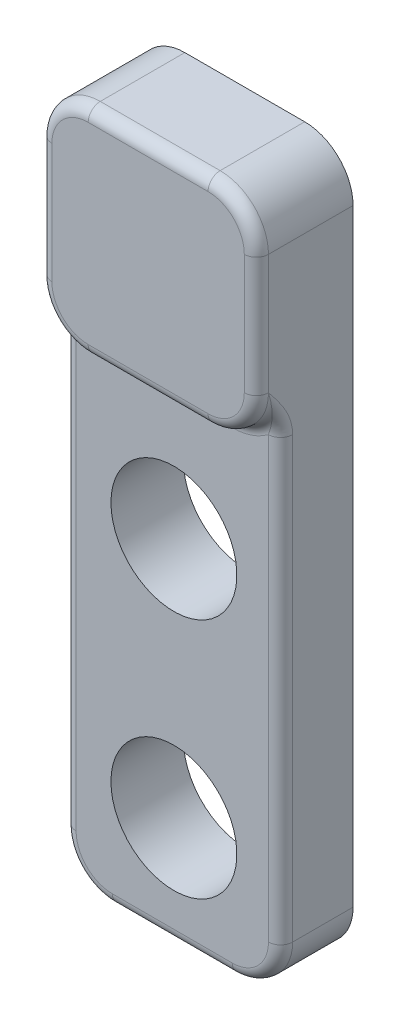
ISO-10303-21;
HEADER;
FILE_DESCRIPTION(('STEP AP214'),'2;1');
FILE_NAME('part.step','',(''),(''),'','','');
FILE_SCHEMA(('AUTOMOTIVE_DESIGN { 1 0 10303 214 1 1 1 1 }'));
ENDSEC;
DATA;
#1=APPLICATION_CONTEXT('core data for automotive mechanical design processes');
#2=APPLICATION_PROTOCOL_DEFINITION('international standard','automotive_design',2000,#1);
#3=PRODUCT_CONTEXT('',#1,'mechanical');
#4=PRODUCT('Part','Part','',(#3));
#5=PRODUCT_RELATED_PRODUCT_CATEGORY('part','',(#4));
#6=PRODUCT_DEFINITION_FORMATION('','',#4);
#7=PRODUCT_DEFINITION_CONTEXT('part definition',#1,'design');
#8=PRODUCT_DEFINITION('design','',#6,#7);
#9=PRODUCT_DEFINITION_SHAPE('','',#8);
#10=(LENGTH_UNIT() NAMED_UNIT(*) SI_UNIT(.MILLI.,.METRE.));
#11=(NAMED_UNIT(*) PLANE_ANGLE_UNIT() SI_UNIT($,.RADIAN.));
#12=(NAMED_UNIT(*) SI_UNIT($,.STERADIAN.) SOLID_ANGLE_UNIT());
#13=UNCERTAINTY_MEASURE_WITH_UNIT(LENGTH_MEASURE(1.E-05),#10,'distance_accuracy_value','');
#14=(GEOMETRIC_REPRESENTATION_CONTEXT(3) GLOBAL_UNCERTAINTY_ASSIGNED_CONTEXT((#13)) GLOBAL_UNIT_ASSIGNED_CONTEXT((#10,
#11,#12)) REPRESENTATION_CONTEXT('',''));
#15=CARTESIAN_POINT('',(0.,0.,0.));
#16=DIRECTION('',(0.,0.,1.));
#17=DIRECTION('',(1.,0.,0.));
#18=AXIS2_PLACEMENT_3D('',#15,#16,#17);
#19=CARTESIAN_POINT('',(-12.731339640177,34.9817721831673,3.81));
#20=DIRECTION('',(0.,0.,-1.));
#21=DIRECTION('',(-1.,0.,0.));
#22=AXIS2_PLACEMENT_3D('',#19,#20,#21);
#23=CYLINDRICAL_SURFACE('',#22,3.30843888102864);
#24=CARTESIAN_POINT('',(-12.731339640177,34.9817721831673,0.));
#25=DIRECTION('',(0.,0.,1.));
#26=DIRECTION('',(1.,0.,0.));
#27=AXIS2_PLACEMENT_3D('',#24,#25,#26);
#28=CIRCLE('',#27,3.30843888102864);
#29=CARTESIAN_POINT('',(-16.0397785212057,34.9817721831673,0.));
#30=VERTEX_POINT('',#29);
#31=EDGE_CURVE('E393',#30,#30,#28,.T.);
#32=CARTESIAN_POINT('',(-12.731339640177,34.9817721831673,1.27));
#33=DIRECTION('',(0.,0.,1.));
#34=DIRECTION('',(1.,0.,0.));
#35=AXIS2_PLACEMENT_3D('',#32,#33,#34);
#36=CIRCLE('',#35,3.30843888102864);
#37=CARTESIAN_POINT('',(-16.0397785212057,34.9817721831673,1.27));
#38=VERTEX_POINT('',#37);
#39=EDGE_CURVE('E394',#38,#38,#36,.T.);
#40=CARTESIAN_POINT('',(-16.0397785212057,34.9817721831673,0.));
#41=CARTESIAN_POINT('',(-16.0397785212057,34.9817721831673,0.0132291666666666));
#42=CARTESIAN_POINT('',(-16.0397785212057,34.9817721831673,0.0264583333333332));
#43=CARTESIAN_POINT('',(-16.0397785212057,34.9817721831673,0.0529166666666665));
#44=CARTESIAN_POINT('',(-16.0397785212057,34.9817721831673,0.0661458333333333));
#45=CARTESIAN_POINT('',(-16.0397785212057,34.9817721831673,0.0926041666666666));
#46=CARTESIAN_POINT('',(-16.0397785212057,34.9817721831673,0.105833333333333));
#47=CARTESIAN_POINT('',(-16.0397785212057,34.9817721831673,0.132291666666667));
#48=CARTESIAN_POINT('',(-16.0397785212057,34.9817721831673,0.145520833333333));
#49=CARTESIAN_POINT('',(-16.0397785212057,34.9817721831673,0.171979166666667));
#50=CARTESIAN_POINT('',(-16.0397785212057,34.9817721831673,0.185208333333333));
#51=CARTESIAN_POINT('',(-16.0397785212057,34.9817721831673,0.211666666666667));
#52=CARTESIAN_POINT('',(-16.0397785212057,34.9817721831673,0.224895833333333));
#53=CARTESIAN_POINT('',(-16.0397785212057,34.9817721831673,0.251354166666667));
#54=CARTESIAN_POINT('',(-16.0397785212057,34.9817721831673,0.264583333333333));
#55=CARTESIAN_POINT('',(-16.0397785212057,34.9817721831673,0.291041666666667));
#56=CARTESIAN_POINT('',(-16.0397785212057,34.9817721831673,0.304270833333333));
#57=CARTESIAN_POINT('',(-16.0397785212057,34.9817721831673,0.330729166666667));
#58=CARTESIAN_POINT('',(-16.0397785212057,34.9817721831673,0.343958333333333));
#59=CARTESIAN_POINT('',(-16.0397785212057,34.9817721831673,0.370416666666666));
#60=CARTESIAN_POINT('',(-16.0397785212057,34.9817721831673,0.383645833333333));
#61=CARTESIAN_POINT('',(-16.0397785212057,34.9817721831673,0.410104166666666));
#62=CARTESIAN_POINT('',(-16.0397785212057,34.9817721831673,0.423333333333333));
#63=CARTESIAN_POINT('',(-16.0397785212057,34.9817721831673,0.449791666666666));
#64=CARTESIAN_POINT('',(-16.0397785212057,34.9817721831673,0.463020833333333));
#65=CARTESIAN_POINT('',(-16.0397785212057,34.9817721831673,0.489479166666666));
#66=CARTESIAN_POINT('',(-16.0397785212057,34.9817721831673,0.502708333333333));
#67=CARTESIAN_POINT('',(-16.0397785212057,34.9817721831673,0.529166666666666));
#68=CARTESIAN_POINT('',(-16.0397785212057,34.9817721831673,0.542395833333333));
#69=CARTESIAN_POINT('',(-16.0397785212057,34.9817721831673,0.568854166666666));
#70=CARTESIAN_POINT('',(-16.0397785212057,34.9817721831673,0.582083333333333));
#71=CARTESIAN_POINT('',(-16.0397785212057,34.9817721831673,0.608541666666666));
#72=CARTESIAN_POINT('',(-16.0397785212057,34.9817721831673,0.621770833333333));
#73=CARTESIAN_POINT('',(-16.0397785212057,34.9817721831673,0.648229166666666));
#74=CARTESIAN_POINT('',(-16.0397785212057,34.9817721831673,0.661458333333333));
#75=CARTESIAN_POINT('',(-16.0397785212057,34.9817721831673,0.687916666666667));
#76=CARTESIAN_POINT('',(-16.0397785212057,34.9817721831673,0.701145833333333));
#77=CARTESIAN_POINT('',(-16.0397785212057,34.9817721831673,0.727604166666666));
#78=CARTESIAN_POINT('',(-16.0397785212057,34.9817721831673,0.740833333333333));
#79=CARTESIAN_POINT('',(-16.0397785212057,34.9817721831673,0.767291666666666));
#80=CARTESIAN_POINT('',(-16.0397785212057,34.9817721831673,0.780520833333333));
#81=CARTESIAN_POINT('',(-16.0397785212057,34.9817721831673,0.806979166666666));
#82=CARTESIAN_POINT('',(-16.0397785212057,34.9817721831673,0.820208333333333));
#83=CARTESIAN_POINT('',(-16.0397785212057,34.9817721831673,0.846666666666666));
#84=CARTESIAN_POINT('',(-16.0397785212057,34.9817721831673,0.859895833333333));
#85=CARTESIAN_POINT('',(-16.0397785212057,34.9817721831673,0.886354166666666));
#86=CARTESIAN_POINT('',(-16.0397785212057,34.9817721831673,0.899583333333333));
#87=CARTESIAN_POINT('',(-16.0397785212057,34.9817721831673,0.926041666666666));
#88=CARTESIAN_POINT('',(-16.0397785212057,34.9817721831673,0.939270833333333));
#89=CARTESIAN_POINT('',(-16.0397785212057,34.9817721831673,0.965729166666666));
#90=CARTESIAN_POINT('',(-16.0397785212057,34.9817721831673,0.978958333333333));
#91=CARTESIAN_POINT('',(-16.0397785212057,34.9817721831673,1.00541666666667));
#92=CARTESIAN_POINT('',(-16.0397785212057,34.9817721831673,1.01864583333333));
#93=CARTESIAN_POINT('',(-16.0397785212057,34.9817721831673,1.04510416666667));
#94=CARTESIAN_POINT('',(-16.0397785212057,34.9817721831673,1.05833333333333));
#95=CARTESIAN_POINT('',(-16.0397785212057,34.9817721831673,1.08479166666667));
#96=CARTESIAN_POINT('',(-16.0397785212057,34.9817721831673,1.09802083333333));
#97=CARTESIAN_POINT('',(-16.0397785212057,34.9817721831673,1.12447916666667));
#98=CARTESIAN_POINT('',(-16.0397785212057,34.9817721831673,1.13770833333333));
#99=CARTESIAN_POINT('',(-16.0397785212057,34.9817721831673,1.16416666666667));
#100=CARTESIAN_POINT('',(-16.0397785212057,34.9817721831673,1.17739583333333));
#101=CARTESIAN_POINT('',(-16.0397785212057,34.9817721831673,1.20385416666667));
#102=CARTESIAN_POINT('',(-16.0397785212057,34.9817721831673,1.21708333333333));
#103=CARTESIAN_POINT('',(-16.0397785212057,34.9817721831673,1.24354166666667));
#104=CARTESIAN_POINT('',(-16.0397785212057,34.9817721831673,1.25677083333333));
#105=CARTESIAN_POINT('',(-16.0397785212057,34.9817721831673,1.27));
#106=B_SPLINE_CURVE_WITH_KNOTS('',3,(#40,#41,#42,#43,#44,#45,#46,#47,#48,#49,#50,#51,#52,#53,
#54,#55,#56,#57,#58,#59,#60,#61,#62,#63,#64,#65,#66,#67,#68,#69,#70,#71,#72,#73,#74,#75,#76,#77,
#78,#79,#80,#81,#82,#83,#84,#85,#86,#87,#88,#89,#90,#91,#92,#93,#94,#95,#96,#97,#98,#99,#100,
#101,#102,#103,#104,#105),.UNSPECIFIED.,.F.,.F.,(4,2,2,2,2,2,2,2,2,2,2,2,2,2,2,2,2,2,2,2,2,2,2,
2,2,2,2,2,2,2,2,2,4),(0.,0.0396874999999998,0.079375,0.1190625,0.15875,0.1984375,0.238125,
0.2778125,0.3175,0.3571875,0.396875,0.4365625,0.47625,0.5159375,0.555625,0.595312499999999,
0.635,0.6746875,0.714375,0.7540625,0.79375,0.833437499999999,0.873125,0.9128125,
0.952499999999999,0.9921875,1.031875,1.0715625,1.11125,1.1509375,1.190625,1.2303125,1.27),.UNSPECIFIED.);
#107=EDGE_CURVE('BSEAM34',#30,#38,#106,.T.);
#108=ORIENTED_EDGE('',*,*,#31,.F.);
#109=ORIENTED_EDGE('',*,*,#39,.T.);
#110=ORIENTED_EDGE('',*,*,#107,.T.);
#111=ORIENTED_EDGE('',*,*,#107,.F.);
#112=EDGE_LOOP('',(#108,#110,#109,#111));
#113=FACE_BOUND('',#112,.T.);
#114=ADVANCED_FACE('F34',(#113),#23,.F.);
#115=CARTESIAN_POINT('',(-15.9661377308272,6.41568824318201,3.81));
#116=DIRECTION('',(0.,0.,1.));
#117=DIRECTION('',(1.,0.,0.));
#118=AXIS2_PLACEMENT_3D('',#115,#116,#117);
#119=PLANE('',#118);
#120=CARTESIAN_POINT('',(-15.9661377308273,32.0486892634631,3.81));
#121=DIRECTION('',(0.,0.,1.));
#122=DIRECTION('',(1.,0.,0.));
#123=AXIS2_PLACEMENT_3D('',#120,#121,#122);
#124=CIRCLE('',#123,3.175);
#125=CARTESIAN_POINT('',(-15.9661377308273,28.8736892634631,3.81));
#126=VERTEX_POINT('',#125);
#127=CARTESIAN_POINT('',(-17.8711377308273,29.5086892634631,3.81));
#128=VERTEX_POINT('',#127);
#129=EDGE_CURVE('E442',#126,#128,#124,.F.);
#130=ORIENTED_EDGE('',*,*,#129,.T.);
#131=DIRECTION('',(0.,-1.,0.));
#132=VECTOR('',#131,1.);
#133=CARTESIAN_POINT('',(-17.8711377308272,6.41568824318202,3.81));
#134=LINE('',#133,#132);
#135=CARTESIAN_POINT('',(-17.8711377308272,6.41568824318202,3.81));
#136=VERTEX_POINT('',#135);
#137=EDGE_CURVE('E450',#128,#136,#134,.T.);
#138=ORIENTED_EDGE('',*,*,#137,.T.);
#139=CARTESIAN_POINT('',(-15.9661377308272,6.41568824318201,3.81));
#140=DIRECTION('',(0.,0.,1.));
#141=DIRECTION('',(1.,0.,0.));
#142=AXIS2_PLACEMENT_3D('',#139,#140,#141);
#143=CIRCLE('',#142,1.905);
#144=CARTESIAN_POINT('',(-15.9661377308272,4.51068824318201,3.81));
#145=VERTEX_POINT('',#144);
#146=EDGE_CURVE('E448',#136,#145,#143,.T.);
#147=ORIENTED_EDGE('',*,*,#146,.T.);
#148=DIRECTION('',(1.,0.,0.));
#149=VECTOR('',#148,1.);
#150=CARTESIAN_POINT('',(-9.6668632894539,4.51068824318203,3.81));
#151=LINE('',#150,#149);
#152=CARTESIAN_POINT('',(-9.6668632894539,4.51068824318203,3.81));
#153=VERTEX_POINT('',#152);
#154=EDGE_CURVE('E446',#145,#153,#151,.T.);
#155=ORIENTED_EDGE('',*,*,#154,.T.);
#156=CARTESIAN_POINT('',(-9.66686328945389,6.41568824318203,3.81));
#157=DIRECTION('',(0.,0.,1.));
#158=DIRECTION('',(1.,0.,0.));
#159=AXIS2_PLACEMENT_3D('',#156,#157,#158);
#160=CIRCLE('',#159,1.905);
#161=CARTESIAN_POINT('',(-7.76186328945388,6.41568824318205,3.81));
#162=VERTEX_POINT('',#161);
#163=EDGE_CURVE('E444',#153,#162,#160,.T.);
#164=ORIENTED_EDGE('',*,*,#163,.T.);
#165=DIRECTION('',(0.,1.,0.));
#166=VECTOR('',#165,1.);
#167=CARTESIAN_POINT('',(-7.76186328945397,32.0486892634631,3.81));
#168=LINE('',#167,#166);
#169=CARTESIAN_POINT('',(-7.76186328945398,29.5086892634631,3.81));
#170=VERTEX_POINT('',#169);
#171=EDGE_CURVE('E438',#162,#170,#168,.T.);
#172=ORIENTED_EDGE('',*,*,#171,.T.);
#173=CARTESIAN_POINT('',(-9.666863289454,32.0486892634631,3.81));
#174=DIRECTION('',(0.,0.,1.));
#175=DIRECTION('',(1.,0.,0.));
#176=AXIS2_PLACEMENT_3D('',#173,#174,#175);
#177=CIRCLE('',#176,3.175);
#178=CARTESIAN_POINT('',(-9.66686328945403,28.8736892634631,3.81));
#179=VERTEX_POINT('',#178);
#180=EDGE_CURVE('E435',#170,#179,#177,.F.);
#181=ORIENTED_EDGE('',*,*,#180,.T.);
#182=DIRECTION('',(1.,0.,0.));
#183=VECTOR('',#182,1.);
#184=CARTESIAN_POINT('',(-15.9661377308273,28.8736892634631,3.81));
#185=LINE('',#184,#183);
#186=EDGE_CURVE('E440',#179,#126,#185,.F.);
#187=ORIENTED_EDGE('',*,*,#186,.T.);
#188=EDGE_LOOP('',(#130,#138,#147,#155,#164,#172,#181,#187));
#189=FACE_BOUND('',#188,.T.);
#190=CARTESIAN_POINT('',(-12.731339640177,9.58177218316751,3.81));
#191=DIRECTION('',(0.,0.,1.));
#192=DIRECTION('',(1.,0.,0.));
#193=AXIS2_PLACEMENT_3D('',#190,#191,#192);
#194=CIRCLE('',#193,3.30843888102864);
#195=CARTESIAN_POINT('',(-16.0397785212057,9.58177218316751,3.81));
#196=VERTEX_POINT('',#195);
#197=EDGE_CURVE('E396',#196,#196,#194,.T.);
#198=ORIENTED_EDGE('',*,*,#197,.F.);
#199=EDGE_LOOP('',(#198));
#200=FACE_BOUND('',#199,.T.);
#201=CARTESIAN_POINT('',(-12.7313396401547,22.2817721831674,3.81));
#202=DIRECTION('',(0.,0.,1.));
#203=DIRECTION('',(1.,0.,0.));
#204=AXIS2_PLACEMENT_3D('',#201,#202,#203);
#205=CIRCLE('',#204,3.30843888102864);
#206=CARTESIAN_POINT('',(-16.0397785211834,22.2817721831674,3.81));
#207=VERTEX_POINT('',#206);
#208=EDGE_CURVE('E403',#207,#207,#205,.T.);
#209=ORIENTED_EDGE('',*,*,#208,.F.);
#210=EDGE_LOOP('',(#209));
#211=FACE_BOUND('',#210,.T.);
#212=ADVANCED_FACE('F350',(#189,#200,#211),#119,.T.);
#213=CARTESIAN_POINT('',(-15.9661377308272,6.41568824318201,0.));
#214=DIRECTION('',(0.,0.,1.));
#215=DIRECTION('',(1.,0.,0.));
#216=AXIS2_PLACEMENT_3D('',#213,#214,#215);
#217=PLANE('',#216);
#218=CARTESIAN_POINT('',(-15.9661377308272,6.41568824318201,0.));
#219=DIRECTION('',(0.,0.,1.));
#220=DIRECTION('',(1.,0.,0.));
#221=AXIS2_PLACEMENT_3D('',#218,#219,#220);
#222=CIRCLE('',#221,2.54);
#223=CARTESIAN_POINT('',(-18.5061377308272,6.41568824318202,0.));
#224=VERTEX_POINT('',#223);
#225=CARTESIAN_POINT('',(-15.9661377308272,3.87568824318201,0.));
#226=VERTEX_POINT('',#225);
#227=EDGE_CURVE('E383',#224,#226,#222,.T.);
#228=ORIENTED_EDGE('',*,*,#227,.F.);
#229=DIRECTION('',(0.,-1.,0.));
#230=VECTOR('',#229,1.);
#231=CARTESIAN_POINT('',(-18.5061377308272,6.41568824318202,0.));
#232=LINE('',#231,#230);
#233=CARTESIAN_POINT('',(-18.5061377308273,38.3479637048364,0.));
#234=VERTEX_POINT('',#233);
#235=EDGE_CURVE('E422',#234,#224,#232,.T.);
#236=ORIENTED_EDGE('',*,*,#235,.F.);
#237=CARTESIAN_POINT('',(-15.9661377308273,38.3479637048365,0.));
#238=DIRECTION('',(0.,0.,1.));
#239=DIRECTION('',(-1.,0.,0.));
#240=AXIS2_PLACEMENT_3D('',#237,#238,#239);
#241=CIRCLE('',#240,2.54);
#242=CARTESIAN_POINT('',(-15.9661377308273,40.8879637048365,0.));
#243=VERTEX_POINT('',#242);
#244=EDGE_CURVE('E419',#243,#234,#241,.T.);
#245=ORIENTED_EDGE('',*,*,#244,.F.);
#246=DIRECTION('',(-1.,0.,0.));
#247=VECTOR('',#246,1.);
#248=CARTESIAN_POINT('',(-15.9661377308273,40.8879637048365,0.));
#249=LINE('',#248,#247);
#250=CARTESIAN_POINT('',(-9.66686328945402,40.8879637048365,0.));
#251=VERTEX_POINT('',#250);
#252=EDGE_CURVE('E416',#251,#243,#249,.T.);
#253=ORIENTED_EDGE('',*,*,#252,.F.);
#254=CARTESIAN_POINT('',(-9.666863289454,38.3479637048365,0.));
#255=DIRECTION('',(0.,0.,1.));
#256=DIRECTION('',(1.,0.,0.));
#257=AXIS2_PLACEMENT_3D('',#254,#255,#256);
#258=CIRCLE('',#257,2.54);
#259=CARTESIAN_POINT('',(-7.126863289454,38.3479637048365,0.));
#260=VERTEX_POINT('',#259);
#261=EDGE_CURVE('E414',#260,#251,#258,.T.);
#262=ORIENTED_EDGE('',*,*,#261,.F.);
#263=DIRECTION('',(0.,1.,0.));
#264=VECTOR('',#263,1.);
#265=CARTESIAN_POINT('',(-7.12686328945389,6.41568824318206,0.));
#266=LINE('',#265,#264);
#267=CARTESIAN_POINT('',(-7.12686328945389,6.41568824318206,0.));
#268=VERTEX_POINT('',#267);
#269=EDGE_CURVE('E196',#268,#260,#266,.T.);
#270=ORIENTED_EDGE('',*,*,#269,.F.);
#271=CARTESIAN_POINT('',(-9.66686328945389,6.41568824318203,0.));
#272=DIRECTION('',(0.,0.,1.));
#273=DIRECTION('',(1.,0.,0.));
#274=AXIS2_PLACEMENT_3D('',#271,#272,#273);
#275=CIRCLE('',#274,2.54);
#276=CARTESIAN_POINT('',(-9.6668632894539,3.87568824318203,0.));
#277=VERTEX_POINT('',#276);
#278=EDGE_CURVE('E410',#277,#268,#275,.T.);
#279=ORIENTED_EDGE('',*,*,#278,.F.);
#280=DIRECTION('',(1.,0.,0.));
#281=VECTOR('',#280,1.);
#282=CARTESIAN_POINT('',(-15.9661377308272,3.87568824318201,0.));
#283=LINE('',#282,#281);
#284=EDGE_CURVE('E408',#226,#277,#283,.T.);
#285=ORIENTED_EDGE('',*,*,#284,.F.);
#286=EDGE_LOOP('',(#228,#236,#245,#253,#262,#270,#279,#285));
#287=FACE_BOUND('',#286,.T.);
#288=CARTESIAN_POINT('',(-12.7313396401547,22.2817721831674,0.));
#289=DIRECTION('',(0.,0.,1.));
#290=DIRECTION('',(1.,0.,0.));
#291=AXIS2_PLACEMENT_3D('',#288,#289,#290);
#292=CIRCLE('',#291,3.30843888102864);
#293=CARTESIAN_POINT('',(-16.0397785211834,22.2817721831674,0.));
#294=VERTEX_POINT('',#293);
#295=EDGE_CURVE('E387',#294,#294,#292,.T.);
#296=ORIENTED_EDGE('',*,*,#295,.T.);
#297=EDGE_LOOP('',(#296));
#298=FACE_BOUND('',#297,.T.);
#299=CARTESIAN_POINT('',(-12.731339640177,9.58177218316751,0.));
#300=DIRECTION('',(0.,0.,1.));
#301=DIRECTION('',(1.,0.,0.));
#302=AXIS2_PLACEMENT_3D('',#299,#300,#301);
#303=CIRCLE('',#302,3.30843888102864);
#304=CARTESIAN_POINT('',(-16.0397785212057,9.58177218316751,0.));
#305=VERTEX_POINT('',#304);
#306=EDGE_CURVE('E391',#305,#305,#303,.T.);
#307=ORIENTED_EDGE('',*,*,#306,.T.);
#308=EDGE_LOOP('',(#307));
#309=FACE_BOUND('',#308,.T.);
#310=ORIENTED_EDGE('',*,*,#31,.T.);
#311=EDGE_LOOP('',(#310));
#312=FACE_BOUND('',#311,.T.);
#313=ADVANCED_FACE('F356',(#287,#298,#309,#312),#217,.F.);
#314=CARTESIAN_POINT('',(-15.9661377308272,6.41568824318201,3.81));
#315=DIRECTION('',(0.,0.,-1.));
#316=DIRECTION('',(-1.,0.,0.));
#317=AXIS2_PLACEMENT_3D('',#314,#315,#316);
#318=CYLINDRICAL_SURFACE('',#317,2.54);
#319=DIRECTION('',(0.,0.,-1.));
#320=VECTOR('',#319,1.);
#321=CARTESIAN_POINT('',(-15.9661377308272,3.87568824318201,3.81));
#322=LINE('',#321,#320);
#323=CARTESIAN_POINT('',(-15.9661377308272,3.87568824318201,3.175));
#324=VERTEX_POINT('',#323);
#325=EDGE_CURVE('E79',#324,#226,#322,.T.);
#326=ORIENTED_EDGE('',*,*,#325,.F.);
#327=CARTESIAN_POINT('',(-15.9661377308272,6.41568824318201,3.175));
#328=DIRECTION('',(0.,0.,1.));
#329=DIRECTION('',(1.,0.,0.));
#330=AXIS2_PLACEMENT_3D('',#327,#328,#329);
#331=CIRCLE('',#330,2.54);
#332=CARTESIAN_POINT('',(-18.5061377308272,6.41568824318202,3.175));
#333=VERTEX_POINT('',#332);
#334=EDGE_CURVE('E457',#324,#333,#331,.F.);
#335=ORIENTED_EDGE('',*,*,#334,.T.);
#336=DIRECTION('',(0.,0.,-1.));
#337=VECTOR('',#336,1.);
#338=CARTESIAN_POINT('',(-18.5061377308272,6.41568824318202,3.81));
#339=LINE('',#338,#337);
#340=EDGE_CURVE('E425',#333,#224,#339,.T.);
#341=ORIENTED_EDGE('',*,*,#340,.T.);
#342=ORIENTED_EDGE('',*,*,#227,.T.);
#343=EDGE_LOOP('',(#326,#335,#341,#342));
#344=FACE_BOUND('',#343,.T.);
#345=ADVANCED_FACE('F233',(#344),#318,.T.);
#346=CARTESIAN_POINT('',(-15.9661377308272,3.87568824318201,3.81));
#347=DIRECTION('',(0.,1.,0.));
#348=DIRECTION('',(-1.,0.,0.));
#349=AXIS2_PLACEMENT_3D('',#346,#347,#348);
#350=PLANE('',#349);
#351=DIRECTION('',(0.,0.,-1.));
#352=VECTOR('',#351,1.);
#353=CARTESIAN_POINT('',(-9.6668632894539,3.87568824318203,3.81));
#354=LINE('',#353,#352);
#355=CARTESIAN_POINT('',(-9.6668632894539,3.87568824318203,3.175));
#356=VERTEX_POINT('',#355);
#357=EDGE_CURVE('E433',#356,#277,#354,.T.);
#358=ORIENTED_EDGE('',*,*,#357,.F.);
#359=DIRECTION('',(1.,0.,0.));
#360=VECTOR('',#359,1.);
#361=CARTESIAN_POINT('',(-15.9661377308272,3.87568824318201,3.175));
#362=LINE('',#361,#360);
#363=EDGE_CURVE('E459',#356,#324,#362,.F.);
#364=ORIENTED_EDGE('',*,*,#363,.T.);
#365=ORIENTED_EDGE('',*,*,#325,.T.);
#366=ORIENTED_EDGE('',*,*,#284,.T.);
#367=EDGE_LOOP('',(#358,#364,#365,#366));
#368=FACE_BOUND('',#367,.T.);
#369=ADVANCED_FACE('F377',(#368),#350,.F.);
#370=CARTESIAN_POINT('',(-9.66686328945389,6.41568824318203,3.81));
#371=DIRECTION('',(0.,0.,-1.));
#372=DIRECTION('',(-1.,0.,0.));
#373=AXIS2_PLACEMENT_3D('',#370,#371,#372);
#374=CYLINDRICAL_SURFACE('',#373,2.54);
#375=DIRECTION('',(0.,0.,-1.));
#376=VECTOR('',#375,1.);
#377=CARTESIAN_POINT('',(-7.12686328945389,6.41568824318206,3.81));
#378=LINE('',#377,#376);
#379=CARTESIAN_POINT('',(-7.12686328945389,6.41568824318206,3.175));
#380=VERTEX_POINT('',#379);
#381=EDGE_CURVE('E198',#380,#268,#378,.T.);
#382=ORIENTED_EDGE('',*,*,#381,.F.);
#383=CARTESIAN_POINT('',(-9.66686328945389,6.41568824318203,3.175));
#384=DIRECTION('',(0.,0.,1.));
#385=DIRECTION('',(1.,0.,0.));
#386=AXIS2_PLACEMENT_3D('',#383,#384,#385);
#387=CIRCLE('',#386,2.54);
#388=EDGE_CURVE('E461',#380,#356,#387,.F.);
#389=ORIENTED_EDGE('',*,*,#388,.T.);
#390=ORIENTED_EDGE('',*,*,#357,.T.);
#391=ORIENTED_EDGE('',*,*,#278,.T.);
#392=EDGE_LOOP('',(#382,#389,#390,#391));
#393=FACE_BOUND('',#392,.T.);
#394=ADVANCED_FACE('F606',(#393),#374,.T.);
#395=CARTESIAN_POINT('',(-7.12686328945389,6.41568824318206,3.81));
#396=DIRECTION('',(-1.,0.,0.));
#397=DIRECTION('',(0.,-1.,0.));
#398=AXIS2_PLACEMENT_3D('',#395,#396,#397);
#399=PLANE('',#398);
#400=DIRECTION('',(0.,0.,-1.));
#401=VECTOR('',#400,1.);
#402=CARTESIAN_POINT('',(-7.126863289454,38.3479637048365,3.81));
#403=LINE('',#402,#401);
#404=CARTESIAN_POINT('',(-7.126863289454,38.3479637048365,4.445));
#405=VERTEX_POINT('',#404);
#406=EDGE_CURVE('E182',#405,#260,#403,.T.);
#407=ORIENTED_EDGE('',*,*,#406,.F.);
#408=DIRECTION('',(0.,1.,0.));
#409=VECTOR('',#408,1.);
#410=CARTESIAN_POINT('',(-7.12686328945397,32.0486892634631,4.445));
#411=LINE('',#410,#409);
#412=CARTESIAN_POINT('',(-7.126863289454,32.0486892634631,4.445));
#413=VERTEX_POINT('',#412);
#414=EDGE_CURVE('E189',#405,#413,#411,.F.);
#415=ORIENTED_EDGE('',*,*,#414,.T.);
#416=CARTESIAN_POINT('',(-7.12686328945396,28.8736892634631,3.28980271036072));
#417=CARTESIAN_POINT('',(-7.12686328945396,29.1614260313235,4.02443729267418));
#418=CARTESIAN_POINT('',(-7.89760127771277,29.0999192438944,3.86740135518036));
#419=CARTESIAN_POINT('',(-7.12686328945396,28.9752181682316,3.24996595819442));
#420=CARTESIAN_POINT('',(-7.12686328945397,29.200693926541,3.98251035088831));
#421=CARTESIAN_POINT('',(-7.87846832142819,29.1622012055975,3.84748297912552));
#422=CARTESIAN_POINT('',(-7.12686328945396,29.0804584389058,3.22117936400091));
#423=CARTESIAN_POINT('',(-7.12686328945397,29.2507026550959,3.9414210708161));
#424=CARTESIAN_POINT('',(-7.85738950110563,29.2279827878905,3.8330896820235));
#425=CARTESIAN_POINT('',(-7.12686328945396,29.2934186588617,3.18380675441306));
#426=CARTESIAN_POINT('',(-7.12686328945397,29.3679293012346,3.86848705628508));
#427=CARTESIAN_POINT('',(-7.81197649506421,29.3646779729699,3.81440337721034));
#428=CARTESIAN_POINT('',(-7.12686328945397,29.4011013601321,3.17501344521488));
#429=CARTESIAN_POINT('',(-7.12686328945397,29.4340548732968,3.8363577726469));
#430=CARTESIAN_POINT('',(-7.78767850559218,29.4355309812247,3.81000672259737));
#431=CARTESIAN_POINT('',(-7.12686328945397,29.6159462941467,3.17498659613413));
#432=CARTESIAN_POINT('',(-7.12686328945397,29.5801337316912,3.78476877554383));
#433=CARTESIAN_POINT('',(-7.7361274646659,29.5816225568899,3.80999329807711));
#434=CARTESIAN_POINT('',(-7.12686328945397,29.7231091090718,3.18369913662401));
#435=CARTESIAN_POINT('',(-7.12686328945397,29.6593325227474,3.7648414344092));
#436=CARTESIAN_POINT('',(-7.70888373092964,29.656846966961,3.81434956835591));
#437=CARTESIAN_POINT('',(-7.12686328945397,29.9353652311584,3.21604309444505));
#438=CARTESIAN_POINT('',(-7.12686328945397,29.8275886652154,3.73899246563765));
#439=CARTESIAN_POINT('',(-7.65194590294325,29.8118415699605,3.83052154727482));
#440=CARTESIAN_POINT('',(-7.12686328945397,30.0404522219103,3.23971443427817));
#441=CARTESIAN_POINT('',(-7.12686328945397,29.9162349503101,3.73257945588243));
#442=CARTESIAN_POINT('',(-7.62224543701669,29.8916234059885,3.84235721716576));
#443=CARTESIAN_POINT('',(-7.12686328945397,30.2326871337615,3.29532571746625));
#444=CARTESIAN_POINT('',(-7.12686328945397,30.087246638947,3.73364077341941));
#445=CARTESIAN_POINT('',(-7.56561204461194,30.0443764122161,3.87016285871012));
#446=CARTESIAN_POINT('',(-7.12686328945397,30.3203101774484,3.32567487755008));
#447=CARTESIAN_POINT('',(-7.12686328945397,30.168282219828,3.73896577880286));
#448=CARTESIAN_POINT('',(-7.53886241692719,30.1167691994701,3.88533743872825));
#449=CARTESIAN_POINT('',(-7.12686328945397,30.492540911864,3.39405526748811));
#450=CARTESIAN_POINT('',(-7.12686328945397,30.3328964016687,3.75916166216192));
#451=CARTESIAN_POINT('',(-7.48510147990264,30.2652461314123,3.91952763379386));
#452=CARTESIAN_POINT('',(-7.12686328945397,30.5771465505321,3.43209161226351));
#453=CARTESIAN_POINT('',(-7.12686328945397,30.4164944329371,3.77376842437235));
#454=CARTESIAN_POINT('',(-7.45809000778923,30.3413327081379,3.93854580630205));
#455=CARTESIAN_POINT('',(-7.12686328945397,30.7433952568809,3.5144880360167));
#456=CARTESIAN_POINT('',(-7.12686328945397,30.5849283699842,3.81142985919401));
#457=CARTESIAN_POINT('',(-7.40479970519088,30.497572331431,3.97974401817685));
#458=CARTESIAN_POINT('',(-7.12686328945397,30.8250319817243,3.5588607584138));
#459=CARTESIAN_POINT('',(-7.12686328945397,30.6699041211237,3.83431190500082));
#460=CARTESIAN_POINT('',(-7.37852246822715,30.577733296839,4.00193037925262));
#461=CARTESIAN_POINT('',(-7.12686328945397,30.9853572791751,3.65256873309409));
#462=CARTESIAN_POINT('',(-7.12686328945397,30.8399454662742,3.88715135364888));
#463=CARTESIAN_POINT('',(-7.32797595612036,30.74210687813,4.04878436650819));
#464=CARTESIAN_POINT('',(-7.12686328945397,31.0640463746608,3.70190309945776));
#465=CARTESIAN_POINT('',(-7.12686328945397,30.925241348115,3.91701237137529));
#466=CARTESIAN_POINT('',(-7.30370632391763,30.8263187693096,4.0734515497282));
#467=CARTESIAN_POINT('',(-7.12686328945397,31.2202230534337,3.80527052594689));
#468=CARTESIAN_POINT('',(-7.12686328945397,31.0968006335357,3.98291241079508));
#469=CARTESIAN_POINT('',(-7.25809447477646,31.0001876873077,4.12513526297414));
#470=CARTESIAN_POINT('',(-7.12686328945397,31.2976661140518,3.85937024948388));
#471=CARTESIAN_POINT('',(-7.12686328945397,31.1834087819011,4.01906508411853));
#472=CARTESIAN_POINT('',(-7.23681034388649,31.0899138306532,4.15218512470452));
#473=CARTESIAN_POINT('',(-7.12686328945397,31.4504692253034,3.97041898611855));
#474=CARTESIAN_POINT('',(-7.12686328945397,31.3558412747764,4.09563666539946));
#475=CARTESIAN_POINT('',(-7.1990422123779,31.2729704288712,4.20770949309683));
#476=CARTESIAN_POINT('',(-7.12686328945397,31.525829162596,4.0273681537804));
#477=CARTESIAN_POINT('',(-7.12686328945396,31.4420566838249,4.13615664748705));
#478=CARTESIAN_POINT('',(-7.18255847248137,31.3663010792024,4.23618407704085));
#479=CARTESIAN_POINT('',(-7.12686328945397,31.6750205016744,4.14305191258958));
#480=CARTESIAN_POINT('',(-7.12686328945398,31.6135656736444,4.21988234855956));
#481=CARTESIAN_POINT('',(-7.15557913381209,31.5555683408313,4.29402595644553));
#482=CARTESIAN_POINT('',(-7.12686328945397,31.7488534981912,4.20178446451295));
#483=CARTESIAN_POINT('',(-7.12686328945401,31.69929521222,4.26326338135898));
#484=CARTESIAN_POINT('',(-7.1450769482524,31.6515019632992,4.32339223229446));
#485=CARTESIAN_POINT('',(-7.12686328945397,31.8957706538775,4.32016661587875));
#486=CARTESIAN_POINT('',(-7.12686328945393,31.8700516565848,4.35126165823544));
#487=CARTESIAN_POINT('',(-7.13083256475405,31.8448401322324,4.38258330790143));
#488=CARTESIAN_POINT('',(-7.12686328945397,31.9688548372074,4.37981618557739));
#489=CARTESIAN_POINT('',(-7.12686328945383,31.9555421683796,4.39610876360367));
#490=CARTESIAN_POINT('',(-7.12709014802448,31.9422446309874,4.41240809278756));
#491=CARTESIAN_POINT('',(-7.12686328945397,32.0441814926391,4.44131942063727));
#492=CARTESIAN_POINT('',(-7.12686328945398,32.0434301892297,4.44223955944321));
#493=CARTESIAN_POINT('',(-7.12686660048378,32.0426788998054,4.44315971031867));
#494=CARTESIAN_POINT('',(-7.12686328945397,32.0464353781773,4.44315971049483));
#495=CARTESIAN_POINT('',(-7.12686328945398,32.0460597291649,4.44361978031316));
#496=CARTESIAN_POINT('',(-7.12686326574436,32.0456840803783,4.44407985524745));
#497=CARTESIAN_POINT('',(-7.12686328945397,32.0486892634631,4.445));
#498=CARTESIAN_POINT('',(-7.12686328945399,32.0486892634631,4.445));
#499=CARTESIAN_POINT('',(-7.126863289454,32.0486892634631,4.445));
#500=(BOUNDED_SURFACE() B_SPLINE_SURFACE(3,2,((#416,#417,#418),(#419,#420,#421),(#422,#423,
#424),(#425,#426,#427),(#428,#429,#430),(#431,#432,#433),(#434,#435,#436),(#437,#438,#439),
(#440,#441,#442),(#443,#444,#445),(#446,#447,#448),(#449,#450,#451),(#452,#453,#454),(#455,#456,
#457),(#458,#459,#460),(#461,#462,#463),(#464,#465,#466),(#467,#468,#469),(#470,#471,#472),
(#473,#474,#475),(#476,#477,#478),(#479,#480,#481),(#482,#483,#484),(#485,#486,#487),(#488,#489,
#490),(#491,#492,#493),(#494,#495,#496),(#497,#498,#499)),.UNSPECIFIED.,.F.,.F.,
.F.) B_SPLINE_SURFACE_WITH_KNOTS((4,2,2,2,2,2,2,2,2,2,2,2,2,4),(3,3),(0.,0.325752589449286,
0.648112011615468,0.969480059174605,1.29170942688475,1.56949467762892,1.84746537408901,
2.12599868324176,2.40448234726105,2.68779694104,2.97112691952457,3.25414429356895,
3.53715250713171,3.54588176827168),(0.,1.),
.UNSPECIFIED.) GEOMETRIC_REPRESENTATION_ITEM() RATIONAL_B_SPLINE_SURFACE(((1.,0.626992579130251,
1.),(1.,0.639022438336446,1.),(1.,0.651897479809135,1.),(1.,0.678759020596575,1.),(1.,
0.692732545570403,1.),(1.,0.721436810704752,1.),(1.,0.736165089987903,1.),(1.,0.766010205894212,
1.),(1.,0.781127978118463,1.),(1.,0.809133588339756,1.),(1.,0.822041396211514,1.),(1.,
0.84739798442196,1.),(1.,0.859846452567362,1.),(1.,0.883910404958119,1.),(1.,0.895524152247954,
1.),(1.,0.917477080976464,1.),(1.,0.927816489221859,1.),(1.,0.946975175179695,1.),(1.,
0.955764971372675,1.),(1.,0.971198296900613,1.),(1.,0.977841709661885,1.),(1.,0.988644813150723,
1.),(1.,0.992807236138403,1.),(1.,0.99844017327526,1.),(1.,0.999910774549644,1.),(1.,
0.999998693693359,1.),(1.,1.00000000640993,1.),(1.,1.,1.))) REPRESENTATION_ITEM('') SURFACE());
#501=CARTESIAN_POINT('',(-7.12686328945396,28.8736892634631,3.28980271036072));
#502=CARTESIAN_POINT('',(-7.12686328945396,28.9752181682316,3.24996595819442));
#503=CARTESIAN_POINT('',(-7.12686328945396,29.0804584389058,3.22117936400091));
#504=CARTESIAN_POINT('',(-7.12686328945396,29.2934186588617,3.18380675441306));
#505=CARTESIAN_POINT('',(-7.12686328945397,29.4011013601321,3.17501344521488));
#506=CARTESIAN_POINT('',(-7.12686328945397,29.6159462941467,3.17498659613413));
#507=CARTESIAN_POINT('',(-7.12686328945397,29.7231091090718,3.18369913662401));
#508=CARTESIAN_POINT('',(-7.12686328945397,29.9353652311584,3.21604309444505));
#509=CARTESIAN_POINT('',(-7.12686328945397,30.0404522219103,3.23971443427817));
#510=CARTESIAN_POINT('',(-7.12686328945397,30.2326871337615,3.29532571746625));
#511=CARTESIAN_POINT('',(-7.12686328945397,30.3203101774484,3.32567487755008));
#512=CARTESIAN_POINT('',(-7.12686328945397,30.492540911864,3.39405526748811));
#513=CARTESIAN_POINT('',(-7.12686328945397,30.5771465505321,3.43209161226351));
#514=CARTESIAN_POINT('',(-7.12686328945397,30.7433952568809,3.5144880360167));
#515=CARTESIAN_POINT('',(-7.12686328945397,30.8250319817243,3.5588607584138));
#516=CARTESIAN_POINT('',(-7.12686328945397,30.9853572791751,3.65256873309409));
#517=CARTESIAN_POINT('',(-7.12686328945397,31.0640463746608,3.70190309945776));
#518=CARTESIAN_POINT('',(-7.12686328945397,31.2202230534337,3.80527052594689));
#519=CARTESIAN_POINT('',(-7.12686328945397,31.2976661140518,3.85937024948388));
#520=CARTESIAN_POINT('',(-7.12686328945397,31.4504692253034,3.97041898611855));
#521=CARTESIAN_POINT('',(-7.12686328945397,31.525829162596,4.0273681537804));
#522=CARTESIAN_POINT('',(-7.12686328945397,31.6750205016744,4.14305191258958));
#523=CARTESIAN_POINT('',(-7.12686328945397,31.7488534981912,4.20178446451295));
#524=CARTESIAN_POINT('',(-7.12686328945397,31.8957706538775,4.32016661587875));
#525=CARTESIAN_POINT('',(-7.12686328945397,31.9688548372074,4.37981618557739));
#526=CARTESIAN_POINT('',(-7.12686328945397,32.0441814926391,4.44131942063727));
#527=CARTESIAN_POINT('',(-7.12686328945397,32.0464353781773,4.44315971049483));
#528=CARTESIAN_POINT('',(-7.12686328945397,32.0486892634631,4.445));
#529=B_SPLINE_CURVE_WITH_KNOTS('',3,(#501,#502,#503,#504,#505,#506,#507,#508,#509,#510,#511,
#512,#513,#514,#515,#516,#517,#518,#519,#520,#521,#522,#523,#524,#525,#526,#527,#528),
.UNSPECIFIED.,.F.,.F.,(4,2,2,2,2,2,2,2,2,2,2,2,2,4),(0.,0.325752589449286,0.648112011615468,
0.969480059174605,1.29170942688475,1.56949467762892,1.84746537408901,2.12599868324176,
2.40448234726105,2.68779694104,2.97112691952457,3.25414429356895,3.53715250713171,
3.54588176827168),.UNSPECIFIED.);
#530=CARTESIAN_POINT('',(-7.12686328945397,29.5086892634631,3.175));
#531=VERTEX_POINT('',#530);
#532=EDGE_CURVE('E11',#413,#531,#529,.F.);
#533=ORIENTED_EDGE('',*,*,#532,.T.);
#534=DIRECTION('',(0.,1.,0.));
#535=VECTOR('',#534,1.);
#536=CARTESIAN_POINT('',(-7.12686328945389,6.41568824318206,3.175));
#537=LINE('',#536,#535);
#538=EDGE_CURVE('E209',#531,#380,#537,.F.);
#539=ORIENTED_EDGE('',*,*,#538,.T.);
#540=ORIENTED_EDGE('',*,*,#381,.T.);
#541=ORIENTED_EDGE('',*,*,#269,.T.);
#542=EDGE_LOOP('',(#407,#415,#533,#539,#540,#541));
#543=FACE_BOUND('',#542,.T.);
#544=ADVANCED_FACE('F192',(#543),#399,.F.);
#545=CARTESIAN_POINT('',(-9.666863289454,38.3479637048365,3.81));
#546=DIRECTION('',(0.,0.,-1.));
#547=DIRECTION('',(-1.,0.,0.));
#548=AXIS2_PLACEMENT_3D('',#545,#546,#547);
#549=CYLINDRICAL_SURFACE('',#548,2.54);
#550=DIRECTION('',(0.,0.,-1.));
#551=VECTOR('',#550,1.);
#552=CARTESIAN_POINT('',(-9.66686328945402,40.8879637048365,3.81));
#553=LINE('',#552,#551);
#554=CARTESIAN_POINT('',(-9.66686328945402,40.8879637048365,4.445));
#555=VERTEX_POINT('',#554);
#556=EDGE_CURVE('E184',#555,#251,#553,.T.);
#557=ORIENTED_EDGE('',*,*,#556,.F.);
#558=CARTESIAN_POINT('',(-9.666863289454,38.3479637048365,4.445));
#559=DIRECTION('',(0.,0.,1.));
#560=DIRECTION('',(1.,0.,0.));
#561=AXIS2_PLACEMENT_3D('',#558,#559,#560);
#562=CIRCLE('',#561,2.54);
#563=EDGE_CURVE('E178',#555,#405,#562,.F.);
#564=ORIENTED_EDGE('',*,*,#563,.T.);
#565=ORIENTED_EDGE('',*,*,#406,.T.);
#566=ORIENTED_EDGE('',*,*,#261,.T.);
#567=EDGE_LOOP('',(#557,#564,#565,#566));
#568=FACE_BOUND('',#567,.T.);
#569=ADVANCED_FACE('F180',(#568),#549,.T.);
#570=CARTESIAN_POINT('',(-15.9661377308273,40.8879637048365,3.81));
#571=DIRECTION('',(0.,-1.,0.));
#572=DIRECTION('',(1.,0.,0.));
#573=AXIS2_PLACEMENT_3D('',#570,#571,#572);
#574=PLANE('',#573);
#575=DIRECTION('',(0.,0.,-1.));
#576=VECTOR('',#575,1.);
#577=CARTESIAN_POINT('',(-15.9661377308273,40.8879637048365,3.81));
#578=LINE('',#577,#576);
#579=CARTESIAN_POINT('',(-15.9661377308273,40.8879637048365,4.445));
#580=VERTEX_POINT('',#579);
#581=EDGE_CURVE('E429',#580,#243,#578,.T.);
#582=ORIENTED_EDGE('',*,*,#581,.F.);
#583=DIRECTION('',(-1.,0.,0.));
#584=VECTOR('',#583,1.);
#585=CARTESIAN_POINT('',(-9.66686328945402,40.8879637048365,4.445));
#586=LINE('',#585,#584);
#587=EDGE_CURVE('E190',#580,#555,#586,.F.);
#588=ORIENTED_EDGE('',*,*,#587,.T.);
#589=ORIENTED_EDGE('',*,*,#556,.T.);
#590=ORIENTED_EDGE('',*,*,#252,.T.);
#591=EDGE_LOOP('',(#582,#588,#589,#590));
#592=FACE_BOUND('',#591,.T.);
#593=ADVANCED_FACE('F483',(#592),#574,.F.);
#594=CARTESIAN_POINT('',(-15.9661377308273,38.3479637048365,3.81));
#595=DIRECTION('',(0.,0.,-1.));
#596=DIRECTION('',(-1.,0.,0.));
#597=AXIS2_PLACEMENT_3D('',#594,#595,#596);
#598=CYLINDRICAL_SURFACE('',#597,2.54);
#599=DIRECTION('',(0.,0.,-1.));
#600=VECTOR('',#599,1.);
#601=CARTESIAN_POINT('',(-18.5061377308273,38.3479637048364,3.81));
#602=LINE('',#601,#600);
#603=CARTESIAN_POINT('',(-18.5061377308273,38.3479637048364,4.445));
#604=VERTEX_POINT('',#603);
#605=EDGE_CURVE('E427',#604,#234,#602,.T.);
#606=ORIENTED_EDGE('',*,*,#605,.F.);
#607=CARTESIAN_POINT('',(-15.9661377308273,38.3479637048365,4.445));
#608=DIRECTION('',(0.,0.,1.));
#609=DIRECTION('',(1.,0.,0.));
#610=AXIS2_PLACEMENT_3D('',#607,#608,#609);
#611=CIRCLE('',#610,2.54);
#612=EDGE_CURVE('E479',#604,#580,#611,.F.);
#613=ORIENTED_EDGE('',*,*,#612,.T.);
#614=ORIENTED_EDGE('',*,*,#581,.T.);
#615=ORIENTED_EDGE('',*,*,#244,.T.);
#616=EDGE_LOOP('',(#606,#613,#614,#615));
#617=FACE_BOUND('',#616,.T.);
#618=ADVANCED_FACE('F583',(#617),#598,.T.);
#619=CARTESIAN_POINT('',(-18.5061377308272,6.41568824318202,3.81));
#620=DIRECTION('',(1.,0.,0.));
#621=DIRECTION('',(0.,1.,0.));
#622=AXIS2_PLACEMENT_3D('',#619,#620,#621);
#623=PLANE('',#622);
#624=DIRECTION('',(0.,-1.,0.));
#625=VECTOR('',#624,1.);
#626=CARTESIAN_POINT('',(-18.5061377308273,32.0486892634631,3.175));
#627=LINE('',#626,#625);
#628=CARTESIAN_POINT('',(-18.5061377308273,29.5086892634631,3.175));
#629=VERTEX_POINT('',#628);
#630=EDGE_CURVE('E455',#333,#629,#627,.F.);
#631=ORIENTED_EDGE('',*,*,#630,.T.);
#632=CARTESIAN_POINT('',(-17.7353997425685,29.0999192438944,3.86740135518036));
#633=CARTESIAN_POINT('',(-18.5061377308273,29.1614260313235,4.02443729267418));
#634=CARTESIAN_POINT('',(-18.5061377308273,28.8736892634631,3.28980271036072));
#635=CARTESIAN_POINT('',(-17.7545326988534,29.1622012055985,3.8474829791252));
#636=CARTESIAN_POINT('',(-18.5061377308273,29.2006939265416,3.98251035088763));
#637=CARTESIAN_POINT('',(-18.5061377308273,28.9752181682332,3.24996595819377));
#638=CARTESIAN_POINT('',(-17.7756115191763,29.2279827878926,3.83308968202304));
#639=CARTESIAN_POINT('',(-18.5061377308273,29.2507026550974,3.94142107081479));
#640=CARTESIAN_POINT('',(-18.5061377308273,29.0804584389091,3.22117936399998));
#641=CARTESIAN_POINT('',(-17.8210245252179,29.3646779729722,3.81440337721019));
#642=CARTESIAN_POINT('',(-18.5061377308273,29.3679293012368,3.86848705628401));
#643=CARTESIAN_POINT('',(-18.5061377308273,29.2934186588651,3.18380675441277));
#644=CARTESIAN_POINT('',(-17.8453225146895,29.4355309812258,3.81000672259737));
#645=CARTESIAN_POINT('',(-18.5061377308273,29.434054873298,3.83635777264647));
#646=CARTESIAN_POINT('',(-18.5061377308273,29.4011013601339,3.17501344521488));
#647=CARTESIAN_POINT('',(-17.8968735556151,29.5816225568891,3.80999329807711));
#648=CARTESIAN_POINT('',(-18.5061377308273,29.5801337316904,3.7847687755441));
#649=CARTESIAN_POINT('',(-18.5061377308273,29.6159462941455,3.17498659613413));
#650=CARTESIAN_POINT('',(-17.9241172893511,29.6568469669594,3.81434956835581));
#651=CARTESIAN_POINT('',(-18.5061377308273,29.6593325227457,3.76484143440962));
#652=CARTESIAN_POINT('',(-18.5061377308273,29.7231091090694,3.18369913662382));
#653=CARTESIAN_POINT('',(-17.9810551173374,29.8118415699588,3.83052154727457));
#654=CARTESIAN_POINT('',(-18.5061377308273,29.8275886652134,3.7389924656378));
#655=CARTESIAN_POINT('',(-18.5061377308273,29.935365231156,3.21604309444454));
#656=CARTESIAN_POINT('',(-18.0107555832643,29.8916234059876,3.84235721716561));
#657=CARTESIAN_POINT('',(-18.5061377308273,29.916234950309,3.73257945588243));
#658=CARTESIAN_POINT('',(-18.5061377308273,30.0404522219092,3.23971443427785));
#659=CARTESIAN_POINT('',(-18.0673889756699,30.0443764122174,3.87016285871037));
#660=CARTESIAN_POINT('',(-18.5061377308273,30.0872466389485,3.73364077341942));
#661=CARTESIAN_POINT('',(-18.5061377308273,30.2326871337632,3.29532571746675));
#662=CARTESIAN_POINT('',(-18.0941386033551,30.1167691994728,3.88533743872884));
#663=CARTESIAN_POINT('',(-18.5061377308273,30.1682822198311,3.73896577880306));
#664=CARTESIAN_POINT('',(-18.5061377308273,30.3203101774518,3.32567487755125));
#665=CARTESIAN_POINT('',(-18.1478995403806,30.2652461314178,3.91952763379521));
#666=CARTESIAN_POINT('',(-18.5061377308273,30.3328964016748,3.75916166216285));
#667=CARTESIAN_POINT('',(-18.5061377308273,30.4925409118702,3.3940552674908));
#668=CARTESIAN_POINT('',(-18.1749110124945,30.3413327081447,3.93854580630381));
#669=CARTESIAN_POINT('',(-18.5061377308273,30.4164944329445,3.77376842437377));
#670=CARTESIAN_POINT('',(-18.5061377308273,30.5771465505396,3.43209161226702));
#671=CARTESIAN_POINT('',(-18.2282013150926,30.4975723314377,3.97974401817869));
#672=CARTESIAN_POINT('',(-18.5061377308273,30.5849283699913,3.81142985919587));
#673=CARTESIAN_POINT('',(-18.5061377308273,30.7433952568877,3.51448803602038));
#674=CARTESIAN_POINT('',(-18.2544785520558,30.5777332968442,4.00193037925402));
#675=CARTESIAN_POINT('',(-18.5061377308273,30.6699041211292,3.83431190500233));
#676=CARTESIAN_POINT('',(-18.5061377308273,30.8250319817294,3.55886075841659));
#677=CARTESIAN_POINT('',(-18.3050250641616,30.7421068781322,4.04878436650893));
#678=CARTESIAN_POINT('',(-18.5061377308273,30.8399454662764,3.88715135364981));
#679=CARTESIAN_POINT('',(-18.5061377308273,30.9853572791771,3.65256873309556));
#680=CARTESIAN_POINT('',(-18.329294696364,30.8263187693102,4.07345154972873));
#681=CARTESIAN_POINT('',(-18.5061377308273,30.9252413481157,3.91701237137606));
#682=CARTESIAN_POINT('',(-18.5061377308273,31.0640463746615,3.70190309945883));
#683=CARTESIAN_POINT('',(-18.3749065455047,31.0001876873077,4.12513526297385));
#684=CARTESIAN_POINT('',(-18.5061377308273,31.0968006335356,3.98291241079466));
#685=CARTESIAN_POINT('',(-18.5061377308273,31.2202230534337,3.80527052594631));
#686=CARTESIAN_POINT('',(-18.3961906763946,31.089913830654,4.15218512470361));
#687=CARTESIAN_POINT('',(-18.5061377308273,31.1834087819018,4.01906508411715));
#688=CARTESIAN_POINT('',(-18.5061377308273,31.2976661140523,3.85937024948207));
#689=CARTESIAN_POINT('',(-18.433958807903,31.2729704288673,4.20770949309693));
#690=CARTESIAN_POINT('',(-18.5061377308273,31.3558412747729,4.09563666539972));
#691=CARTESIAN_POINT('',(-18.5061377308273,31.4504692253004,3.97041898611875));
#692=CARTESIAN_POINT('',(-18.4504425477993,31.366301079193,4.23618407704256));
#693=CARTESIAN_POINT('',(-18.5061377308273,31.4420566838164,4.13615664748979));
#694=CARTESIAN_POINT('',(-18.5061377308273,31.5258291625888,4.02736815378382));
#695=CARTESIAN_POINT('',(-18.4774218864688,31.5555683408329,4.29402595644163));
#696=CARTESIAN_POINT('',(-18.5061377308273,31.6135656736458,4.2198823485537));
#697=CARTESIAN_POINT('',(-18.5061377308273,31.6750205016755,4.1430519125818));
#698=CARTESIAN_POINT('',(-18.4879240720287,31.6515019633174,4.32339223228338));
#699=CARTESIAN_POINT('',(-18.5061377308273,31.699295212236,4.26326338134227));
#700=CARTESIAN_POINT('',(-18.5061377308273,31.7488534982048,4.20178446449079));
#701=CARTESIAN_POINT('',(-18.5021684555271,31.8448401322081,4.38258330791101));
#702=CARTESIAN_POINT('',(-18.5061377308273,31.8700516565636,4.35126165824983));
#703=CARTESIAN_POINT('',(-18.5061377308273,31.8957706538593,4.32016661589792));
#704=CARTESIAN_POINT('',(-18.5059108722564,31.9422446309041,4.41240809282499));
#705=CARTESIAN_POINT('',(-18.5061377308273,31.9555421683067,4.39610876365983));
#706=CARTESIAN_POINT('',(-18.5061377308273,31.9688548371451,4.37981618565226));
#707=CARTESIAN_POINT('',(-18.5061344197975,32.0426788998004,4.44315971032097));
#708=CARTESIAN_POINT('',(-18.5061377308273,32.0434301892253,4.44223955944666));
#709=CARTESIAN_POINT('',(-18.5061377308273,32.0441814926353,4.44131942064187));
#710=CARTESIAN_POINT('',(-18.506137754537,32.0456840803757,4.44407985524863));
#711=CARTESIAN_POINT('',(-18.5061377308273,32.0460597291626,4.44361978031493));
#712=CARTESIAN_POINT('',(-18.5061377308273,32.0464353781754,4.44315971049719));
#713=CARTESIAN_POINT('',(-18.5061377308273,32.0486892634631,4.445));
#714=CARTESIAN_POINT('',(-18.5061377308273,32.0486892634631,4.445));
#715=CARTESIAN_POINT('',(-18.5061377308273,32.0486892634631,4.445));
#716=(BOUNDED_SURFACE() B_SPLINE_SURFACE(3,2,((#632,#633,#634),(#635,#636,#637),(#638,#639,
#640),(#641,#642,#643),(#644,#645,#646),(#647,#648,#649),(#650,#651,#652),(#653,#654,#655),
(#656,#657,#658),(#659,#660,#661),(#662,#663,#664),(#665,#666,#667),(#668,#669,#670),(#671,#672,
#673),(#674,#675,#676),(#677,#678,#679),(#680,#681,#682),(#683,#684,#685),(#686,#687,#688),
(#689,#690,#691),(#692,#693,#694),(#695,#696,#697),(#698,#699,#700),(#701,#702,#703),(#704,#705,
#706),(#707,#708,#709),(#710,#711,#712),(#713,#714,#715)),.UNSPECIFIED.,.F.,.F.,
.F.) B_SPLINE_SURFACE_WITH_KNOTS((4,2,2,2,2,2,2,2,2,2,2,2,2,4),(3,3),(0.,0.32575258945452,
0.648112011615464,0.969480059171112,1.29170942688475,1.56949467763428,1.84746537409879,
2.12599868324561,2.40448234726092,2.68779694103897,2.97112691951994,3.25414429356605,
3.53715250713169,3.54588176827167),(0.,1.),
.UNSPECIFIED.) GEOMETRIC_REPRESENTATION_ITEM() RATIONAL_B_SPLINE_SURFACE(((1.,0.626992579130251,
1.),(1.,0.639022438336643,1.),(1.,0.651897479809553,1.),(1.,0.678759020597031,1.),(1.,
0.692732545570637,1.),(1.,0.721436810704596,1.),(1.,0.736165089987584,1.),(1.,0.766010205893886,
1.),(1.,0.781127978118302,1.),(1.,0.809133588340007,1.),(1.,0.822041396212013,1.),(1.,
0.847397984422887,1.),(1.,0.859846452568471,1.),(1.,0.883910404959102,1.),(1.,0.895524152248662,
1.),(1.,0.917477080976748,1.),(1.,0.927816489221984,1.),(1.,0.946975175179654,1.),(1.,
0.955764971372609,1.),(1.,0.971198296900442,1.),(1.,0.977841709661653,1.),(1.,0.988644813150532,
1.),(1.,0.992807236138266,1.),(1.,0.998440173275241,1.),(1.,0.999910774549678,1.),(1.,
0.999998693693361,1.),(1.,1.00000000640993,1.),(1.,1.,1.))) REPRESENTATION_ITEM('') SURFACE());
#717=CARTESIAN_POINT('',(-18.5061377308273,28.8736892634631,3.28980271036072));
#718=CARTESIAN_POINT('',(-18.5061377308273,28.9752181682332,3.24996595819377));
#719=CARTESIAN_POINT('',(-18.5061377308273,29.0804584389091,3.22117936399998));
#720=CARTESIAN_POINT('',(-18.5061377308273,29.2934186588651,3.18380675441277));
#721=CARTESIAN_POINT('',(-18.5061377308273,29.4011013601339,3.17501344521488));
#722=CARTESIAN_POINT('',(-18.5061377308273,29.6159462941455,3.17498659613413));
#723=CARTESIAN_POINT('',(-18.5061377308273,29.7231091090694,3.18369913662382));
#724=CARTESIAN_POINT('',(-18.5061377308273,29.935365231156,3.21604309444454));
#725=CARTESIAN_POINT('',(-18.5061377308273,30.0404522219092,3.23971443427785));
#726=CARTESIAN_POINT('',(-18.5061377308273,30.2326871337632,3.29532571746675));
#727=CARTESIAN_POINT('',(-18.5061377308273,30.3203101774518,3.32567487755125));
#728=CARTESIAN_POINT('',(-18.5061377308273,30.4925409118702,3.3940552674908));
#729=CARTESIAN_POINT('',(-18.5061377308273,30.5771465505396,3.43209161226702));
#730=CARTESIAN_POINT('',(-18.5061377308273,30.7433952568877,3.51448803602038));
#731=CARTESIAN_POINT('',(-18.5061377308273,30.8250319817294,3.55886075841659));
#732=CARTESIAN_POINT('',(-18.5061377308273,30.9853572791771,3.65256873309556));
#733=CARTESIAN_POINT('',(-18.5061377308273,31.0640463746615,3.70190309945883));
#734=CARTESIAN_POINT('',(-18.5061377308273,31.2202230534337,3.80527052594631));
#735=CARTESIAN_POINT('',(-18.5061377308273,31.2976661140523,3.85937024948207));
#736=CARTESIAN_POINT('',(-18.5061377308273,31.4504692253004,3.97041898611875));
#737=CARTESIAN_POINT('',(-18.5061377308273,31.5258291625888,4.02736815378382));
#738=CARTESIAN_POINT('',(-18.5061377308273,31.6750205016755,4.1430519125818));
#739=CARTESIAN_POINT('',(-18.5061377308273,31.7488534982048,4.20178446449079));
#740=CARTESIAN_POINT('',(-18.5061377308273,31.8957706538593,4.32016661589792));
#741=CARTESIAN_POINT('',(-18.5061377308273,31.968854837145,4.37981618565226));
#742=CARTESIAN_POINT('',(-18.5061377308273,32.0441814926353,4.44131942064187));
#743=CARTESIAN_POINT('',(-18.5061377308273,32.0464353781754,4.44315971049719));
#744=CARTESIAN_POINT('',(-18.5061377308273,32.0486892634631,4.445));
#745=B_SPLINE_CURVE_WITH_KNOTS('',3,(#717,#718,#719,#720,#721,#722,#723,#724,#725,#726,#727,
#728,#729,#730,#731,#732,#733,#734,#735,#736,#737,#738,#739,#740,#741,#742,#743,#744),
.UNSPECIFIED.,.F.,.F.,(4,2,2,2,2,2,2,2,2,2,2,2,2,4),(0.,0.32575258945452,0.648112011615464,
0.969480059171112,1.29170942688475,1.56949467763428,1.84746537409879,2.12599868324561,
2.40448234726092,2.68779694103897,2.97112691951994,3.25414429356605,3.53715250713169,
3.54588176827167),.UNSPECIFIED.);
#746=CARTESIAN_POINT('',(-18.5061377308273,32.0486892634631,4.445));
#747=VERTEX_POINT('',#746);
#748=EDGE_CURVE('E44',#629,#747,#745,.T.);
#749=ORIENTED_EDGE('',*,*,#748,.T.);
#750=DIRECTION('',(0.,-1.,0.));
#751=VECTOR('',#750,1.);
#752=CARTESIAN_POINT('',(-18.5061377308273,38.3479637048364,4.445));
#753=LINE('',#752,#751);
#754=EDGE_CURVE('E453',#747,#604,#753,.F.);
#755=ORIENTED_EDGE('',*,*,#754,.T.);
#756=ORIENTED_EDGE('',*,*,#605,.T.);
#757=ORIENTED_EDGE('',*,*,#235,.T.);
#758=ORIENTED_EDGE('',*,*,#340,.F.);
#759=EDGE_LOOP('',(#631,#749,#755,#756,#757,#758));
#760=FACE_BOUND('',#759,.T.);
#761=ADVANCED_FACE('F226',(#760),#623,.F.);
#762=CARTESIAN_POINT('',(-12.7313396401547,22.2817721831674,3.81));
#763=DIRECTION('',(0.,0.,-1.));
#764=DIRECTION('',(-1.,0.,0.));
#765=AXIS2_PLACEMENT_3D('',#762,#763,#764);
#766=CYLINDRICAL_SURFACE('',#765,3.30843888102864);
#767=CARTESIAN_POINT('',(-16.0397785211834,22.2817721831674,3.81));
#768=CARTESIAN_POINT('',(-16.0397785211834,22.2817721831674,3.7703125));
#769=CARTESIAN_POINT('',(-16.0397785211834,22.2817721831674,3.730625));
#770=CARTESIAN_POINT('',(-16.0397785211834,22.2817721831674,3.65125));
#771=CARTESIAN_POINT('',(-16.0397785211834,22.2817721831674,3.6115625));
#772=CARTESIAN_POINT('',(-16.0397785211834,22.2817721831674,3.5321875));
#773=CARTESIAN_POINT('',(-16.0397785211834,22.2817721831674,3.4925));
#774=CARTESIAN_POINT('',(-16.0397785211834,22.2817721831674,3.413125));
#775=CARTESIAN_POINT('',(-16.0397785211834,22.2817721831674,3.3734375));
#776=CARTESIAN_POINT('',(-16.0397785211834,22.2817721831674,3.2940625));
#777=CARTESIAN_POINT('',(-16.0397785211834,22.2817721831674,3.254375));
#778=CARTESIAN_POINT('',(-16.0397785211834,22.2817721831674,3.175));
#779=CARTESIAN_POINT('',(-16.0397785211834,22.2817721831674,3.1353125));
#780=CARTESIAN_POINT('',(-16.0397785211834,22.2817721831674,3.0559375));
#781=CARTESIAN_POINT('',(-16.0397785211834,22.2817721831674,3.01625));
#782=CARTESIAN_POINT('',(-16.0397785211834,22.2817721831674,2.936875));
#783=CARTESIAN_POINT('',(-16.0397785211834,22.2817721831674,2.8971875));
#784=CARTESIAN_POINT('',(-16.0397785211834,22.2817721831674,2.8178125));
#785=CARTESIAN_POINT('',(-16.0397785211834,22.2817721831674,2.778125));
#786=CARTESIAN_POINT('',(-16.0397785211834,22.2817721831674,2.69875));
#787=CARTESIAN_POINT('',(-16.0397785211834,22.2817721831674,2.6590625));
#788=CARTESIAN_POINT('',(-16.0397785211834,22.2817721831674,2.5796875));
#789=CARTESIAN_POINT('',(-16.0397785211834,22.2817721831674,2.54));
#790=CARTESIAN_POINT('',(-16.0397785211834,22.2817721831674,2.460625));
#791=CARTESIAN_POINT('',(-16.0397785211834,22.2817721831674,2.4209375));
#792=CARTESIAN_POINT('',(-16.0397785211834,22.2817721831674,2.3415625));
#793=CARTESIAN_POINT('',(-16.0397785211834,22.2817721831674,2.301875));
#794=CARTESIAN_POINT('',(-16.0397785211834,22.2817721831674,2.2225));
#795=CARTESIAN_POINT('',(-16.0397785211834,22.2817721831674,2.1828125));
#796=CARTESIAN_POINT('',(-16.0397785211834,22.2817721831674,2.1034375));
#797=CARTESIAN_POINT('',(-16.0397785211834,22.2817721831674,2.06375));
#798=CARTESIAN_POINT('',(-16.0397785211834,22.2817721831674,1.984375));
#799=CARTESIAN_POINT('',(-16.0397785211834,22.2817721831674,1.9446875));
#800=CARTESIAN_POINT('',(-16.0397785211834,22.2817721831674,1.8653125));
#801=CARTESIAN_POINT('',(-16.0397785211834,22.2817721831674,1.825625));
#802=CARTESIAN_POINT('',(-16.0397785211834,22.2817721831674,1.74625));
#803=CARTESIAN_POINT('',(-16.0397785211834,22.2817721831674,1.7065625));
#804=CARTESIAN_POINT('',(-16.0397785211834,22.2817721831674,1.6271875));
#805=CARTESIAN_POINT('',(-16.0397785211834,22.2817721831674,1.5875));
#806=CARTESIAN_POINT('',(-16.0397785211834,22.2817721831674,1.508125));
#807=CARTESIAN_POINT('',(-16.0397785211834,22.2817721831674,1.4684375));
#808=CARTESIAN_POINT('',(-16.0397785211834,22.2817721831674,1.3890625));
#809=CARTESIAN_POINT('',(-16.0397785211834,22.2817721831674,1.349375));
#810=CARTESIAN_POINT('',(-16.0397785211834,22.2817721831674,1.27));
#811=CARTESIAN_POINT('',(-16.0397785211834,22.2817721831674,1.2303125));
#812=CARTESIAN_POINT('',(-16.0397785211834,22.2817721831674,1.1509375));
#813=CARTESIAN_POINT('',(-16.0397785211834,22.2817721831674,1.11125));
#814=CARTESIAN_POINT('',(-16.0397785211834,22.2817721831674,1.031875));
#815=CARTESIAN_POINT('',(-16.0397785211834,22.2817721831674,0.9921875));
#816=CARTESIAN_POINT('',(-16.0397785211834,22.2817721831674,0.9128125));
#817=CARTESIAN_POINT('',(-16.0397785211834,22.2817721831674,0.873125));
#818=CARTESIAN_POINT('',(-16.0397785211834,22.2817721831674,0.79375));
#819=CARTESIAN_POINT('',(-16.0397785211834,22.2817721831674,0.7540625));
#820=CARTESIAN_POINT('',(-16.0397785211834,22.2817721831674,0.6746875));
#821=CARTESIAN_POINT('',(-16.0397785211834,22.2817721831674,0.635));
#822=CARTESIAN_POINT('',(-16.0397785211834,22.2817721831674,0.555625));
#823=CARTESIAN_POINT('',(-16.0397785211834,22.2817721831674,0.5159375));
#824=CARTESIAN_POINT('',(-16.0397785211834,22.2817721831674,0.4365625));
#825=CARTESIAN_POINT('',(-16.0397785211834,22.2817721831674,0.396875));
#826=CARTESIAN_POINT('',(-16.0397785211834,22.2817721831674,0.3175));
#827=CARTESIAN_POINT('',(-16.0397785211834,22.2817721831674,0.2778125));
#828=CARTESIAN_POINT('',(-16.0397785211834,22.2817721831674,0.1984375));
#829=CARTESIAN_POINT('',(-16.0397785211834,22.2817721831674,0.15875));
#830=CARTESIAN_POINT('',(-16.0397785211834,22.2817721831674,0.0793749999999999));
#831=CARTESIAN_POINT('',(-16.0397785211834,22.2817721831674,0.0396874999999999));
#832=CARTESIAN_POINT('',(-16.0397785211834,22.2817721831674,0.));
#833=B_SPLINE_CURVE_WITH_KNOTS('',3,(#767,#768,#769,#770,#771,#772,#773,#774,#775,#776,#777,
#778,#779,#780,#781,#782,#783,#784,#785,#786,#787,#788,#789,#790,#791,#792,#793,#794,#795,#796,
#797,#798,#799,#800,#801,#802,#803,#804,#805,#806,#807,#808,#809,#810,#811,#812,#813,#814,#815,
#816,#817,#818,#819,#820,#821,#822,#823,#824,#825,#826,#827,#828,#829,#830,#831,#832),
.UNSPECIFIED.,.F.,.F.,(4,2,2,2,2,2,2,2,2,2,2,2,2,2,2,2,2,2,2,2,2,2,2,2,2,2,2,2,2,2,2,2,4),(0.,
0.1190625,0.238125,0.3571875,0.47625,0.595312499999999,0.714375,0.833437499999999,
0.952499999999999,1.0715625,1.190625,1.3096875,1.42875,1.5478125,1.666875,1.7859375,1.905,
2.0240625,2.143125,2.2621875,2.38125,2.5003125,2.619375,2.7384375,2.8575,2.9765625,3.095625,
3.2146875,3.33375,3.4528125,3.571875,3.6909375,3.81),.UNSPECIFIED.);
#834=EDGE_CURVE('BSEAM368',#207,#294,#833,.T.);
#835=ORIENTED_EDGE('',*,*,#208,.T.);
#836=ORIENTED_EDGE('',*,*,#295,.F.);
#837=ORIENTED_EDGE('',*,*,#834,.T.);
#838=ORIENTED_EDGE('',*,*,#834,.F.);
#839=EDGE_LOOP('',(#835,#837,#836,#838));
#840=FACE_BOUND('',#839,.T.);
#841=ADVANCED_FACE('F368',(#840),#766,.F.);
#842=CARTESIAN_POINT('',(-12.731339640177,9.58177218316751,3.81));
#843=DIRECTION('',(0.,0.,-1.));
#844=DIRECTION('',(-1.,0.,0.));
#845=AXIS2_PLACEMENT_3D('',#842,#843,#844);
#846=CYLINDRICAL_SURFACE('',#845,3.30843888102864);
#847=CARTESIAN_POINT('',(-16.0397785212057,9.58177218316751,3.81));
#848=CARTESIAN_POINT('',(-16.0397785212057,9.58177218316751,3.7703125));
#849=CARTESIAN_POINT('',(-16.0397785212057,9.58177218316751,3.730625));
#850=CARTESIAN_POINT('',(-16.0397785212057,9.58177218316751,3.65125));
#851=CARTESIAN_POINT('',(-16.0397785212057,9.58177218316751,3.6115625));
#852=CARTESIAN_POINT('',(-16.0397785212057,9.58177218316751,3.5321875));
#853=CARTESIAN_POINT('',(-16.0397785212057,9.58177218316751,3.4925));
#854=CARTESIAN_POINT('',(-16.0397785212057,9.58177218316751,3.413125));
#855=CARTESIAN_POINT('',(-16.0397785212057,9.58177218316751,3.3734375));
#856=CARTESIAN_POINT('',(-16.0397785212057,9.58177218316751,3.2940625));
#857=CARTESIAN_POINT('',(-16.0397785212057,9.58177218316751,3.254375));
#858=CARTESIAN_POINT('',(-16.0397785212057,9.58177218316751,3.175));
#859=CARTESIAN_POINT('',(-16.0397785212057,9.58177218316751,3.1353125));
#860=CARTESIAN_POINT('',(-16.0397785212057,9.58177218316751,3.0559375));
#861=CARTESIAN_POINT('',(-16.0397785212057,9.58177218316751,3.01625));
#862=CARTESIAN_POINT('',(-16.0397785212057,9.58177218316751,2.936875));
#863=CARTESIAN_POINT('',(-16.0397785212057,9.58177218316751,2.8971875));
#864=CARTESIAN_POINT('',(-16.0397785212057,9.58177218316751,2.8178125));
#865=CARTESIAN_POINT('',(-16.0397785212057,9.58177218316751,2.778125));
#866=CARTESIAN_POINT('',(-16.0397785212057,9.58177218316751,2.69875));
#867=CARTESIAN_POINT('',(-16.0397785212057,9.58177218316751,2.6590625));
#868=CARTESIAN_POINT('',(-16.0397785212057,9.58177218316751,2.5796875));
#869=CARTESIAN_POINT('',(-16.0397785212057,9.58177218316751,2.54));
#870=CARTESIAN_POINT('',(-16.0397785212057,9.58177218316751,2.460625));
#871=CARTESIAN_POINT('',(-16.0397785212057,9.58177218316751,2.4209375));
#872=CARTESIAN_POINT('',(-16.0397785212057,9.58177218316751,2.3415625));
#873=CARTESIAN_POINT('',(-16.0397785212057,9.58177218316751,2.301875));
#874=CARTESIAN_POINT('',(-16.0397785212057,9.58177218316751,2.2225));
#875=CARTESIAN_POINT('',(-16.0397785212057,9.58177218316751,2.1828125));
#876=CARTESIAN_POINT('',(-16.0397785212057,9.58177218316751,2.1034375));
#877=CARTESIAN_POINT('',(-16.0397785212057,9.58177218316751,2.06375));
#878=CARTESIAN_POINT('',(-16.0397785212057,9.58177218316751,1.984375));
#879=CARTESIAN_POINT('',(-16.0397785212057,9.58177218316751,1.9446875));
#880=CARTESIAN_POINT('',(-16.0397785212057,9.58177218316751,1.8653125));
#881=CARTESIAN_POINT('',(-16.0397785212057,9.58177218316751,1.825625));
#882=CARTESIAN_POINT('',(-16.0397785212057,9.58177218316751,1.74625));
#883=CARTESIAN_POINT('',(-16.0397785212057,9.58177218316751,1.7065625));
#884=CARTESIAN_POINT('',(-16.0397785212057,9.58177218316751,1.6271875));
#885=CARTESIAN_POINT('',(-16.0397785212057,9.58177218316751,1.5875));
#886=CARTESIAN_POINT('',(-16.0397785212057,9.58177218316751,1.508125));
#887=CARTESIAN_POINT('',(-16.0397785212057,9.58177218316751,1.4684375));
#888=CARTESIAN_POINT('',(-16.0397785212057,9.58177218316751,1.3890625));
#889=CARTESIAN_POINT('',(-16.0397785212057,9.58177218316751,1.349375));
#890=CARTESIAN_POINT('',(-16.0397785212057,9.58177218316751,1.27));
#891=CARTESIAN_POINT('',(-16.0397785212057,9.58177218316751,1.2303125));
#892=CARTESIAN_POINT('',(-16.0397785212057,9.58177218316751,1.1509375));
#893=CARTESIAN_POINT('',(-16.0397785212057,9.58177218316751,1.11125));
#894=CARTESIAN_POINT('',(-16.0397785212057,9.58177218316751,1.031875));
#895=CARTESIAN_POINT('',(-16.0397785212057,9.58177218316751,0.9921875));
#896=CARTESIAN_POINT('',(-16.0397785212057,9.58177218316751,0.9128125));
#897=CARTESIAN_POINT('',(-16.0397785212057,9.58177218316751,0.873125));
#898=CARTESIAN_POINT('',(-16.0397785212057,9.58177218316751,0.79375));
#899=CARTESIAN_POINT('',(-16.0397785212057,9.58177218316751,0.7540625));
#900=CARTESIAN_POINT('',(-16.0397785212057,9.58177218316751,0.6746875));
#901=CARTESIAN_POINT('',(-16.0397785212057,9.58177218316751,0.635));
#902=CARTESIAN_POINT('',(-16.0397785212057,9.58177218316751,0.555625));
#903=CARTESIAN_POINT('',(-16.0397785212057,9.58177218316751,0.5159375));
#904=CARTESIAN_POINT('',(-16.0397785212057,9.58177218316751,0.4365625));
#905=CARTESIAN_POINT('',(-16.0397785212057,9.58177218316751,0.396875));
#906=CARTESIAN_POINT('',(-16.0397785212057,9.58177218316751,0.3175));
#907=CARTESIAN_POINT('',(-16.0397785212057,9.58177218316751,0.2778125));
#908=CARTESIAN_POINT('',(-16.0397785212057,9.58177218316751,0.1984375));
#909=CARTESIAN_POINT('',(-16.0397785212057,9.58177218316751,0.15875));
#910=CARTESIAN_POINT('',(-16.0397785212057,9.58177218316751,0.0793749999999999));
#911=CARTESIAN_POINT('',(-16.0397785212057,9.58177218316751,0.0396874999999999));
#912=CARTESIAN_POINT('',(-16.0397785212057,9.58177218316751,0.));
#913=B_SPLINE_CURVE_WITH_KNOTS('',3,(#847,#848,#849,#850,#851,#852,#853,#854,#855,#856,#857,
#858,#859,#860,#861,#862,#863,#864,#865,#866,#867,#868,#869,#870,#871,#872,#873,#874,#875,#876,
#877,#878,#879,#880,#881,#882,#883,#884,#885,#886,#887,#888,#889,#890,#891,#892,#893,#894,#895,
#896,#897,#898,#899,#900,#901,#902,#903,#904,#905,#906,#907,#908,#909,#910,#911,#912),
.UNSPECIFIED.,.F.,.F.,(4,2,2,2,2,2,2,2,2,2,2,2,2,2,2,2,2,2,2,2,2,2,2,2,2,2,2,2,2,2,2,2,4),(0.,
0.1190625,0.238125,0.3571875,0.47625,0.595312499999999,0.714375,0.833437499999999,
0.952499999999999,1.0715625,1.190625,1.3096875,1.42875,1.5478125,1.666875,1.7859375,1.905,
2.0240625,2.143125,2.2621875,2.38125,2.5003125,2.619375,2.7384375,2.8575,2.9765625,3.095625,
3.2146875,3.33375,3.4528125,3.571875,3.6909375,3.81),.UNSPECIFIED.);
#914=EDGE_CURVE('BSEAM365',#196,#305,#913,.T.);
#915=ORIENTED_EDGE('',*,*,#197,.T.);
#916=ORIENTED_EDGE('',*,*,#306,.F.);
#917=ORIENTED_EDGE('',*,*,#914,.T.);
#918=ORIENTED_EDGE('',*,*,#914,.F.);
#919=EDGE_LOOP('',(#915,#917,#916,#918));
#920=FACE_BOUND('',#919,.T.);
#921=ADVANCED_FACE('F365',(#920),#846,.F.);
#922=CARTESIAN_POINT('',(-9.666863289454,38.3479637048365,1.27));
#923=DIRECTION('',(0.,0.,1.));
#924=DIRECTION('',(1.,0.,0.));
#925=AXIS2_PLACEMENT_3D('',#922,#923,#924);
#926=PLANE('',#925);
#927=ORIENTED_EDGE('',*,*,#39,.F.);
#928=EDGE_LOOP('',(#927));
#929=FACE_BOUND('',#928,.T.);
#930=ADVANCED_FACE('F363',(#929),#926,.F.);
#931=CARTESIAN_POINT('',(-9.666863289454,38.3479637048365,5.08));
#932=DIRECTION('',(0.,0.,1.));
#933=DIRECTION('',(1.,0.,0.));
#934=AXIS2_PLACEMENT_3D('',#931,#932,#933);
#935=PLANE('',#934);
#936=DIRECTION('',(1.,0.,0.));
#937=VECTOR('',#936,1.);
#938=CARTESIAN_POINT('',(-9.66686328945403,30.1436892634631,5.08));
#939=LINE('',#938,#937);
#940=CARTESIAN_POINT('',(-15.9661377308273,30.1436892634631,5.08));
#941=VERTEX_POINT('',#940);
#942=CARTESIAN_POINT('',(-9.66686328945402,30.1436892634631,5.08));
#943=VERTEX_POINT('',#942);
#944=EDGE_CURVE('E474',#941,#943,#939,.T.);
#945=ORIENTED_EDGE('',*,*,#944,.T.);
#946=CARTESIAN_POINT('',(-9.666863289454,32.0486892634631,5.08));
#947=DIRECTION('',(0.,0.,1.));
#948=DIRECTION('',(1.,0.,0.));
#949=AXIS2_PLACEMENT_3D('',#946,#947,#948);
#950=CIRCLE('',#949,1.905);
#951=CARTESIAN_POINT('',(-7.76186328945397,32.0486892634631,5.08));
#952=VERTEX_POINT('',#951);
#953=EDGE_CURVE('E476',#943,#952,#950,.T.);
#954=ORIENTED_EDGE('',*,*,#953,.T.);
#955=DIRECTION('',(0.,1.,0.));
#956=VECTOR('',#955,1.);
#957=CARTESIAN_POINT('',(-7.761863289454,38.3479637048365,5.08));
#958=LINE('',#957,#956);
#959=CARTESIAN_POINT('',(-7.761863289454,38.3479637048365,5.08));
#960=VERTEX_POINT('',#959);
#961=EDGE_CURVE('E463',#952,#960,#958,.T.);
#962=ORIENTED_EDGE('',*,*,#961,.T.);
#963=CARTESIAN_POINT('',(-9.666863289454,38.3479637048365,5.08));
#964=DIRECTION('',(0.,0.,1.));
#965=DIRECTION('',(1.,0.,0.));
#966=AXIS2_PLACEMENT_3D('',#963,#964,#965);
#967=CIRCLE('',#966,1.905);
#968=CARTESIAN_POINT('',(-9.66686328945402,40.2529637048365,5.08));
#969=VERTEX_POINT('',#968);
#970=EDGE_CURVE('E203',#960,#969,#967,.T.);
#971=ORIENTED_EDGE('',*,*,#970,.T.);
#972=DIRECTION('',(-1.,0.,0.));
#973=VECTOR('',#972,1.);
#974=CARTESIAN_POINT('',(-15.9661377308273,40.2529637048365,5.08));
#975=LINE('',#974,#973);
#976=CARTESIAN_POINT('',(-15.9661377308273,40.2529637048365,5.08));
#977=VERTEX_POINT('',#976);
#978=EDGE_CURVE('E466',#969,#977,#975,.T.);
#979=ORIENTED_EDGE('',*,*,#978,.T.);
#980=CARTESIAN_POINT('',(-15.9661377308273,38.3479637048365,5.08));
#981=DIRECTION('',(0.,0.,1.));
#982=DIRECTION('',(1.,0.,0.));
#983=AXIS2_PLACEMENT_3D('',#980,#981,#982);
#984=CIRCLE('',#983,1.905);
#985=CARTESIAN_POINT('',(-17.8711377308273,38.3479637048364,5.08));
#986=VERTEX_POINT('',#985);
#987=EDGE_CURVE('E468',#977,#986,#984,.T.);
#988=ORIENTED_EDGE('',*,*,#987,.T.);
#989=DIRECTION('',(0.,-1.,0.));
#990=VECTOR('',#989,1.);
#991=CARTESIAN_POINT('',(-17.8711377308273,32.0486892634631,5.08));
#992=LINE('',#991,#990);
#993=CARTESIAN_POINT('',(-17.8711377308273,32.0486892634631,5.08));
#994=VERTEX_POINT('',#993);
#995=EDGE_CURVE('E470',#986,#994,#992,.T.);
#996=ORIENTED_EDGE('',*,*,#995,.T.);
#997=CARTESIAN_POINT('',(-15.9661377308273,32.0486892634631,5.08));
#998=DIRECTION('',(0.,0.,1.));
#999=DIRECTION('',(1.,0.,0.));
#1000=AXIS2_PLACEMENT_3D('',#997,#998,#999);
#1001=CIRCLE('',#1000,1.905);
#1002=EDGE_CURVE('E472',#994,#941,#1001,.T.);
#1003=ORIENTED_EDGE('',*,*,#1002,.T.);
#1004=EDGE_LOOP('',(#945,#954,#962,#971,#979,#988,#996,#1003));
#1005=FACE_BOUND('',#1004,.T.);
#1006=ADVANCED_FACE('F348',(#1005),#935,.T.);
#1007=CARTESIAN_POINT('',(-9.666863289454,38.3479637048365,4.445));
#1008=DIRECTION('',(0.,0.,1.));
#1009=DIRECTION('',(1.,0.,0.));
#1010=AXIS2_PLACEMENT_3D('',#1007,#1008,#1009);
#1011=TOROIDAL_SURFACE('',#1010,1.905,0.635);
#1012=CARTESIAN_POINT('',(-7.761863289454,38.3479637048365,4.445));
#1013=DIRECTION('',(0.,-1.,0.));
#1014=DIRECTION('',(0.,0.,-1.));
#1015=AXIS2_PLACEMENT_3D('',#1012,#1013,#1014);
#1016=CIRCLE('',#1015,0.635);
#1017=EDGE_CURVE('E202',#405,#960,#1016,.T.);
#1018=ORIENTED_EDGE('',*,*,#1017,.F.);
#1019=ORIENTED_EDGE('',*,*,#563,.F.);
#1020=CARTESIAN_POINT('',(-9.66686328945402,40.2529637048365,4.445));
#1021=DIRECTION('',(-1.,0.,0.));
#1022=DIRECTION('',(0.,-1.,0.));
#1023=AXIS2_PLACEMENT_3D('',#1020,#1021,#1022);
#1024=CIRCLE('',#1023,0.635);
#1025=EDGE_CURVE('E38',#969,#555,#1024,.T.);
#1026=ORIENTED_EDGE('',*,*,#1025,.F.);
#1027=ORIENTED_EDGE('',*,*,#970,.F.);
#1028=EDGE_LOOP('',(#1018,#1019,#1026,#1027));
#1029=FACE_BOUND('',#1028,.T.);
#1030=ADVANCED_FACE('F36',(#1029),#1011,.T.);
#1031=CARTESIAN_POINT('',(-9.666863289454,40.2529637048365,4.445));
#1032=DIRECTION('',(1.,0.,0.));
#1033=DIRECTION('',(0.,1.,0.));
#1034=AXIS2_PLACEMENT_3D('',#1031,#1032,#1033);
#1035=CYLINDRICAL_SURFACE('',#1034,0.635);
#1036=ORIENTED_EDGE('',*,*,#1025,.T.);
#1037=ORIENTED_EDGE('',*,*,#587,.F.);
#1038=CARTESIAN_POINT('',(-15.9661377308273,40.2529637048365,4.445));
#1039=DIRECTION('',(-1.,0.,0.));
#1040=DIRECTION('',(0.,-1.,0.));
#1041=AXIS2_PLACEMENT_3D('',#1038,#1039,#1040);
#1042=CIRCLE('',#1041,0.635);
#1043=EDGE_CURVE('E206',#977,#580,#1042,.T.);
#1044=ORIENTED_EDGE('',*,*,#1043,.F.);
#1045=ORIENTED_EDGE('',*,*,#978,.F.);
#1046=EDGE_LOOP('',(#1036,#1037,#1044,#1045));
#1047=FACE_BOUND('',#1046,.T.);
#1048=ADVANCED_FACE('F342',(#1047),#1035,.T.);
#1049=CARTESIAN_POINT('',(-7.761863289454,38.3479637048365,4.445));
#1050=DIRECTION('',(0.,-1.,0.));
#1051=DIRECTION('',(1.,0.,0.));
#1052=AXIS2_PLACEMENT_3D('',#1049,#1050,#1051);
#1053=CYLINDRICAL_SURFACE('',#1052,0.635);
#1054=ORIENTED_EDGE('',*,*,#1017,.T.);
#1055=ORIENTED_EDGE('',*,*,#961,.F.);
#1056=CARTESIAN_POINT('',(-7.76186328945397,32.0486892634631,4.445));
#1057=DIRECTION('',(0.,-1.,0.));
#1058=DIRECTION('',(0.,0.,-1.));
#1059=AXIS2_PLACEMENT_3D('',#1056,#1057,#1058);
#1060=CIRCLE('',#1059,0.635);
#1061=EDGE_CURVE('E208',#413,#952,#1060,.T.);
#1062=ORIENTED_EDGE('',*,*,#1061,.F.);
#1063=ORIENTED_EDGE('',*,*,#414,.F.);
#1064=EDGE_LOOP('',(#1054,#1055,#1062,#1063));
#1065=FACE_BOUND('',#1064,.T.);
#1066=ADVANCED_FACE('F207',(#1065),#1053,.T.);
#1067=CARTESIAN_POINT('',(-7.76186328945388,6.41568824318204,3.175));
#1068=DIRECTION('',(0.,-1.,0.));
#1069=DIRECTION('',(1.,0.,0.));
#1070=AXIS2_PLACEMENT_3D('',#1067,#1068,#1069);
#1071=CYLINDRICAL_SURFACE('',#1070,0.635);
#1072=CARTESIAN_POINT('',(-7.76186328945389,6.41568824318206,3.175));
#1073=DIRECTION('',(0.,-1.,0.));
#1074=DIRECTION('',(0.,0.,-1.));
#1075=AXIS2_PLACEMENT_3D('',#1072,#1073,#1074);
#1076=CIRCLE('',#1075,0.635);
#1077=EDGE_CURVE('E497',#380,#162,#1076,.T.);
#1078=ORIENTED_EDGE('',*,*,#1077,.F.);
#1079=ORIENTED_EDGE('',*,*,#538,.F.);
#1080=CARTESIAN_POINT('',(-7.76186328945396,29.5086892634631,3.175));
#1081=DIRECTION('',(0.,1.,0.));
#1082=DIRECTION('',(-1.,0.,0.));
#1083=AXIS2_PLACEMENT_3D('',#1080,#1081,#1082);
#1084=CIRCLE('',#1083,0.635);
#1085=EDGE_CURVE('E492',#170,#531,#1084,.T.);
#1086=ORIENTED_EDGE('',*,*,#1085,.F.);
#1087=ORIENTED_EDGE('',*,*,#171,.F.);
#1088=EDGE_LOOP('',(#1078,#1079,#1086,#1087));
#1089=FACE_BOUND('',#1088,.T.);
#1090=ADVANCED_FACE('F336',(#1089),#1071,.T.);
#1091=CARTESIAN_POINT('',(-15.9661377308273,38.3479637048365,4.445));
#1092=DIRECTION('',(0.,0.,1.));
#1093=DIRECTION('',(1.,0.,0.));
#1094=AXIS2_PLACEMENT_3D('',#1091,#1092,#1093);
#1095=TOROIDAL_SURFACE('',#1094,1.905,0.635);
#1096=ORIENTED_EDGE('',*,*,#1043,.T.);
#1097=ORIENTED_EDGE('',*,*,#612,.F.);
#1098=CARTESIAN_POINT('',(-17.8711377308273,38.3479637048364,4.445));
#1099=DIRECTION('',(0.,-1.,0.));
#1100=DIRECTION('',(0.,0.,-1.));
#1101=AXIS2_PLACEMENT_3D('',#1098,#1099,#1100);
#1102=CIRCLE('',#1101,0.635);
#1103=EDGE_CURVE('E500',#986,#604,#1102,.T.);
#1104=ORIENTED_EDGE('',*,*,#1103,.F.);
#1105=ORIENTED_EDGE('',*,*,#987,.F.);
#1106=EDGE_LOOP('',(#1096,#1097,#1104,#1105));
#1107=FACE_BOUND('',#1106,.T.);
#1108=ADVANCED_FACE('F333',(#1107),#1095,.T.);
#1109=CARTESIAN_POINT('',(-9.666863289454,32.0486892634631,4.445));
#1110=DIRECTION('',(0.,0.,1.));
#1111=DIRECTION('',(1.,0.,0.));
#1112=AXIS2_PLACEMENT_3D('',#1109,#1110,#1111);
#1113=TOROIDAL_SURFACE('',#1112,1.905,0.635);
#1114=ORIENTED_EDGE('',*,*,#1061,.T.);
#1115=ORIENTED_EDGE('',*,*,#953,.F.);
#1116=CARTESIAN_POINT('',(-9.66686328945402,30.1436892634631,4.445));
#1117=DIRECTION('',(-1.,0.,0.));
#1118=DIRECTION('',(0.,-1.,0.));
#1119=AXIS2_PLACEMENT_3D('',#1116,#1117,#1118);
#1120=CIRCLE('',#1119,0.635);
#1121=CARTESIAN_POINT('',(-9.66686328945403,29.5086892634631,4.445));
#1122=VERTEX_POINT('',#1121);
#1123=EDGE_CURVE('E70',#1122,#943,#1120,.T.);
#1124=ORIENTED_EDGE('',*,*,#1123,.F.);
#1125=CARTESIAN_POINT('',(-9.666863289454,32.0486892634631,4.445));
#1126=DIRECTION('',(0.,0.,1.));
#1127=DIRECTION('',(1.,0.,0.));
#1128=AXIS2_PLACEMENT_3D('',#1125,#1126,#1127);
#1129=CIRCLE('',#1128,2.54);
#1130=EDGE_CURVE('E318',#413,#1122,#1129,.F.);
#1131=ORIENTED_EDGE('',*,*,#1130,.F.);
#1132=EDGE_LOOP('',(#1114,#1115,#1124,#1131));
#1133=FACE_BOUND('',#1132,.T.);
#1134=ADVANCED_FACE('F305',(#1133),#1113,.T.);
#1135=ORIENTED_EDGE('',*,*,#1085,.T.);
#1136=ORIENTED_EDGE('',*,*,#532,.F.);
#1137=CARTESIAN_POINT('',(-7.89760127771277,29.0999192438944,3.86740135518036));
#1138=CARTESIAN_POINT('',(-7.87846832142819,29.1622012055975,3.84748297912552));
#1139=CARTESIAN_POINT('',(-7.85738950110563,29.2279827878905,3.8330896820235));
#1140=CARTESIAN_POINT('',(-7.81197649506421,29.3646779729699,3.81440337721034));
#1141=CARTESIAN_POINT('',(-7.78767850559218,29.4355309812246,3.81000672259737));
#1142=CARTESIAN_POINT('',(-7.7361274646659,29.5816225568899,3.80999329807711));
#1143=CARTESIAN_POINT('',(-7.70888373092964,29.656846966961,3.81434956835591));
#1144=CARTESIAN_POINT('',(-7.65194590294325,29.8118415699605,3.83052154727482));
#1145=CARTESIAN_POINT('',(-7.62224543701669,29.8916234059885,3.84235721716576));
#1146=CARTESIAN_POINT('',(-7.56561204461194,30.0443764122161,3.87016285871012));
#1147=CARTESIAN_POINT('',(-7.53886241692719,30.1167691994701,3.88533743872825));
#1148=CARTESIAN_POINT('',(-7.48510147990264,30.2652461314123,3.91952763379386));
#1149=CARTESIAN_POINT('',(-7.45809000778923,30.3413327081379,3.93854580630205));
#1150=CARTESIAN_POINT('',(-7.40479970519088,30.497572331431,3.97974401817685));
#1151=CARTESIAN_POINT('',(-7.37852246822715,30.577733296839,4.00193037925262));
#1152=CARTESIAN_POINT('',(-7.32797595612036,30.74210687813,4.04878436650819));
#1153=CARTESIAN_POINT('',(-7.30370632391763,30.8263187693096,4.0734515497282));
#1154=CARTESIAN_POINT('',(-7.25809447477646,31.0001876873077,4.12513526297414));
#1155=CARTESIAN_POINT('',(-7.23681034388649,31.0899138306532,4.15218512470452));
#1156=CARTESIAN_POINT('',(-7.1990422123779,31.2729704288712,4.20770949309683));
#1157=CARTESIAN_POINT('',(-7.18255847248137,31.3663010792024,4.23618407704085));
#1158=CARTESIAN_POINT('',(-7.15557913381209,31.5555683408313,4.29402595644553));
#1159=CARTESIAN_POINT('',(-7.1450769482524,31.6515019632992,4.32339223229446));
#1160=CARTESIAN_POINT('',(-7.13083256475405,31.8448401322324,4.38258330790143));
#1161=CARTESIAN_POINT('',(-7.12709014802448,31.9422446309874,4.41240809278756));
#1162=CARTESIAN_POINT('',(-7.12686660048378,32.0426788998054,4.44315971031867));
#1163=CARTESIAN_POINT('',(-7.12686326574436,32.0456840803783,4.44407985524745));
#1164=CARTESIAN_POINT('',(-7.126863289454,32.0486892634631,4.445));
#1165=B_SPLINE_CURVE_WITH_KNOTS('',3,(#1137,#1138,#1139,#1140,#1141,#1142,#1143,#1144,#1145,
#1146,#1147,#1148,#1149,#1150,#1151,#1152,#1153,#1154,#1155,#1156,#1157,#1158,#1159,#1160,#1161,
#1162,#1163,#1164),.UNSPECIFIED.,.F.,.F.,(4,2,2,2,2,2,2,2,2,2,2,2,2,4),(0.,0.325752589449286,
0.648112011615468,0.969480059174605,1.29170942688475,1.56949467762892,1.84746537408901,
2.12599868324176,2.40448234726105,2.68779694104,2.97112691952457,3.25414429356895,
3.53715250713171,3.54588176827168),.UNSPECIFIED.);
#1166=EDGE_CURVE('E294',#170,#413,#1165,.T.);
#1167=ORIENTED_EDGE('',*,*,#1166,.F.);
#1168=EDGE_LOOP('',(#1135,#1136,#1167));
#1169=FACE_BOUND('',#1168,.T.);
#1170=ADVANCED_FACE('F300',(#1169),#500,.T.);
#1171=CARTESIAN_POINT('',(-9.66686328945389,6.41568824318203,3.175));
#1172=DIRECTION('',(0.,0.,1.));
#1173=DIRECTION('',(1.,0.,0.));
#1174=AXIS2_PLACEMENT_3D('',#1171,#1172,#1173);
#1175=TOROIDAL_SURFACE('',#1174,1.905,0.635);
#1176=ORIENTED_EDGE('',*,*,#1077,.T.);
#1177=ORIENTED_EDGE('',*,*,#163,.F.);
#1178=CARTESIAN_POINT('',(-9.66686328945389,4.51068824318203,3.175));
#1179=DIRECTION('',(-1.,0.,0.));
#1180=DIRECTION('',(0.,0.,1.));
#1181=AXIS2_PLACEMENT_3D('',#1178,#1179,#1180);
#1182=CIRCLE('',#1181,0.635);
#1183=EDGE_CURVE('E503',#356,#153,#1182,.T.);
#1184=ORIENTED_EDGE('',*,*,#1183,.F.);
#1185=ORIENTED_EDGE('',*,*,#388,.F.);
#1186=EDGE_LOOP('',(#1176,#1177,#1184,#1185));
#1187=FACE_BOUND('',#1186,.T.);
#1188=ADVANCED_FACE('F304',(#1187),#1175,.T.);
#1189=CARTESIAN_POINT('',(-17.8711377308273,38.3479637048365,4.445));
#1190=DIRECTION('',(0.,1.,0.));
#1191=DIRECTION('',(-1.,0.,0.));
#1192=AXIS2_PLACEMENT_3D('',#1189,#1190,#1191);
#1193=CYLINDRICAL_SURFACE('',#1192,0.635);
#1194=ORIENTED_EDGE('',*,*,#1103,.T.);
#1195=ORIENTED_EDGE('',*,*,#754,.F.);
#1196=CARTESIAN_POINT('',(-17.8711377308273,32.0486892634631,4.445));
#1197=DIRECTION('',(0.,-1.,0.));
#1198=DIRECTION('',(0.,0.,-1.));
#1199=AXIS2_PLACEMENT_3D('',#1196,#1197,#1198);
#1200=CIRCLE('',#1199,0.635);
#1201=EDGE_CURVE('E507',#994,#747,#1200,.T.);
#1202=ORIENTED_EDGE('',*,*,#1201,.F.);
#1203=ORIENTED_EDGE('',*,*,#995,.F.);
#1204=EDGE_LOOP('',(#1194,#1195,#1202,#1203));
#1205=FACE_BOUND('',#1204,.T.);
#1206=ADVANCED_FACE('F324',(#1205),#1193,.T.);
#1207=CARTESIAN_POINT('',(-9.66686328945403,30.1436892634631,4.445));
#1208=DIRECTION('',(1.,0.,0.));
#1209=DIRECTION('',(0.,1.,0.));
#1210=AXIS2_PLACEMENT_3D('',#1207,#1208,#1209);
#1211=CYLINDRICAL_SURFACE('',#1210,0.635);
#1212=ORIENTED_EDGE('',*,*,#1123,.T.);
#1213=ORIENTED_EDGE('',*,*,#944,.F.);
#1214=CARTESIAN_POINT('',(-15.9661377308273,30.1436892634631,4.445));
#1215=DIRECTION('',(-1.,0.,0.));
#1216=DIRECTION('',(0.,-1.,0.));
#1217=AXIS2_PLACEMENT_3D('',#1214,#1215,#1216);
#1218=CIRCLE('',#1217,0.635);
#1219=CARTESIAN_POINT('',(-15.9661377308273,29.5086892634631,4.445));
#1220=VERTEX_POINT('',#1219);
#1221=EDGE_CURVE('E62',#1220,#941,#1218,.T.);
#1222=ORIENTED_EDGE('',*,*,#1221,.F.);
#1223=DIRECTION('',(1.,0.,0.));
#1224=VECTOR('',#1223,1.);
#1225=CARTESIAN_POINT('',(-9.66686328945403,29.5086892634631,4.445));
#1226=LINE('',#1225,#1224);
#1227=EDGE_CURVE('E515',#1122,#1220,#1226,.F.);
#1228=ORIENTED_EDGE('',*,*,#1227,.F.);
#1229=EDGE_LOOP('',(#1212,#1213,#1222,#1228));
#1230=FACE_BOUND('',#1229,.T.);
#1231=ADVANCED_FACE('F289',(#1230),#1211,.T.);
#1232=CARTESIAN_POINT('',(-9.666863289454,32.0486892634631,4.445));
#1233=DIRECTION('',(0.,0.,1.));
#1234=DIRECTION('',(1.,0.,0.));
#1235=AXIS2_PLACEMENT_3D('',#1232,#1233,#1234);
#1236=TOROIDAL_SURFACE('',#1235,3.175,0.635);
#1237=ORIENTED_EDGE('',*,*,#1166,.T.);
#1238=ORIENTED_EDGE('',*,*,#1130,.T.);
#1239=CARTESIAN_POINT('',(-9.66686328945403,28.8736892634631,4.445));
#1240=DIRECTION('',(1.,0.,0.));
#1241=DIRECTION('',(0.,1.,0.));
#1242=AXIS2_PLACEMENT_3D('',#1239,#1240,#1241);
#1243=CIRCLE('',#1242,0.635);
#1244=EDGE_CURVE('E517',#179,#1122,#1243,.T.);
#1245=ORIENTED_EDGE('',*,*,#1244,.F.);
#1246=ORIENTED_EDGE('',*,*,#180,.F.);
#1247=EDGE_LOOP('',(#1237,#1238,#1245,#1246));
#1248=FACE_BOUND('',#1247,.T.);
#1249=ADVANCED_FACE('F284',(#1248),#1236,.F.);
#1250=CARTESIAN_POINT('',(-15.9661377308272,4.51068824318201,3.175));
#1251=DIRECTION('',(-1.,0.,0.));
#1252=DIRECTION('',(0.,-1.,0.));
#1253=AXIS2_PLACEMENT_3D('',#1250,#1251,#1252);
#1254=CYLINDRICAL_SURFACE('',#1253,0.635);
#1255=ORIENTED_EDGE('',*,*,#1183,.T.);
#1256=ORIENTED_EDGE('',*,*,#154,.F.);
#1257=CARTESIAN_POINT('',(-15.9661377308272,4.51068824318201,3.175));
#1258=DIRECTION('',(-1.,0.,0.));
#1259=DIRECTION('',(0.,0.,1.));
#1260=AXIS2_PLACEMENT_3D('',#1257,#1258,#1259);
#1261=CIRCLE('',#1260,0.635);
#1262=EDGE_CURVE('E520',#324,#145,#1261,.T.);
#1263=ORIENTED_EDGE('',*,*,#1262,.F.);
#1264=ORIENTED_EDGE('',*,*,#363,.F.);
#1265=EDGE_LOOP('',(#1255,#1256,#1263,#1264));
#1266=FACE_BOUND('',#1265,.T.);
#1267=ADVANCED_FACE('F280',(#1266),#1254,.T.);
#1268=CARTESIAN_POINT('',(-15.9661377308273,32.0486892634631,4.445));
#1269=DIRECTION('',(0.,0.,1.));
#1270=DIRECTION('',(1.,0.,0.));
#1271=AXIS2_PLACEMENT_3D('',#1268,#1269,#1270);
#1272=TOROIDAL_SURFACE('',#1271,1.905,0.635);
#1273=ORIENTED_EDGE('',*,*,#1002,.F.);
#1274=ORIENTED_EDGE('',*,*,#1201,.T.);
#1275=CARTESIAN_POINT('',(-15.9661377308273,32.0486892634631,4.445));
#1276=DIRECTION('',(0.,0.,1.));
#1277=DIRECTION('',(1.,0.,0.));
#1278=AXIS2_PLACEMENT_3D('',#1275,#1276,#1277);
#1279=CIRCLE('',#1278,2.54);
#1280=EDGE_CURVE('E523',#1220,#747,#1279,.F.);
#1281=ORIENTED_EDGE('',*,*,#1280,.F.);
#1282=ORIENTED_EDGE('',*,*,#1221,.T.);
#1283=EDGE_LOOP('',(#1273,#1274,#1281,#1282));
#1284=FACE_BOUND('',#1283,.T.);
#1285=ADVANCED_FACE('F276',(#1284),#1272,.T.);
#1286=CARTESIAN_POINT('',(-9.66686328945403,28.8736892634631,4.445));
#1287=DIRECTION('',(-1.,0.,0.));
#1288=DIRECTION('',(0.,-1.,0.));
#1289=AXIS2_PLACEMENT_3D('',#1286,#1287,#1288);
#1290=CYLINDRICAL_SURFACE('',#1289,0.635);
#1291=ORIENTED_EDGE('',*,*,#1244,.T.);
#1292=ORIENTED_EDGE('',*,*,#1227,.T.);
#1293=CARTESIAN_POINT('',(-15.9661377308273,28.8736892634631,4.445));
#1294=DIRECTION('',(1.,0.,0.));
#1295=DIRECTION('',(0.,1.,0.));
#1296=AXIS2_PLACEMENT_3D('',#1293,#1294,#1295);
#1297=CIRCLE('',#1296,0.635);
#1298=EDGE_CURVE('E525',#126,#1220,#1297,.T.);
#1299=ORIENTED_EDGE('',*,*,#1298,.F.);
#1300=ORIENTED_EDGE('',*,*,#186,.F.);
#1301=EDGE_LOOP('',(#1291,#1292,#1299,#1300));
#1302=FACE_BOUND('',#1301,.T.);
#1303=ADVANCED_FACE('F272',(#1302),#1290,.F.);
#1304=CARTESIAN_POINT('',(-15.9661377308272,6.41568824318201,3.175));
#1305=DIRECTION('',(0.,0.,1.));
#1306=DIRECTION('',(1.,0.,0.));
#1307=AXIS2_PLACEMENT_3D('',#1304,#1305,#1306);
#1308=TOROIDAL_SURFACE('',#1307,1.905,0.635);
#1309=ORIENTED_EDGE('',*,*,#1262,.T.);
#1310=ORIENTED_EDGE('',*,*,#146,.F.);
#1311=CARTESIAN_POINT('',(-17.8711377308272,6.41568824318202,3.175));
#1312=DIRECTION('',(0.,1.,0.));
#1313=DIRECTION('',(0.,0.,1.));
#1314=AXIS2_PLACEMENT_3D('',#1311,#1312,#1313);
#1315=CIRCLE('',#1314,0.635);
#1316=EDGE_CURVE('E261',#333,#136,#1315,.T.);
#1317=ORIENTED_EDGE('',*,*,#1316,.F.);
#1318=ORIENTED_EDGE('',*,*,#334,.F.);
#1319=EDGE_LOOP('',(#1309,#1310,#1317,#1318));
#1320=FACE_BOUND('',#1319,.T.);
#1321=ADVANCED_FACE('F269',(#1320),#1308,.T.);
#1322=CARTESIAN_POINT('',(-15.9661377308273,32.0486892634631,4.445));
#1323=DIRECTION('',(0.,0.,1.));
#1324=DIRECTION('',(1.,0.,0.));
#1325=AXIS2_PLACEMENT_3D('',#1322,#1323,#1324);
#1326=TOROIDAL_SURFACE('',#1325,3.175,0.635);
#1327=ORIENTED_EDGE('',*,*,#1298,.T.);
#1328=ORIENTED_EDGE('',*,*,#1280,.T.);
#1329=CARTESIAN_POINT('',(-17.7353997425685,29.0999192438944,3.86740135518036));
#1330=CARTESIAN_POINT('',(-17.7545326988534,29.1622012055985,3.8474829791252));
#1331=CARTESIAN_POINT('',(-17.7756115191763,29.2279827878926,3.83308968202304));
#1332=CARTESIAN_POINT('',(-17.8210245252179,29.3646779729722,3.81440337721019));
#1333=CARTESIAN_POINT('',(-17.8453225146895,29.4355309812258,3.81000672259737));
#1334=CARTESIAN_POINT('',(-17.8968735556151,29.5816225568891,3.80999329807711));
#1335=CARTESIAN_POINT('',(-17.924117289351,29.6568469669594,3.81434956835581));
#1336=CARTESIAN_POINT('',(-17.9810551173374,29.8118415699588,3.83052154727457));
#1337=CARTESIAN_POINT('',(-18.0107555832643,29.8916234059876,3.84235721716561));
#1338=CARTESIAN_POINT('',(-18.0673889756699,30.0443764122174,3.87016285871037));
#1339=CARTESIAN_POINT('',(-18.0941386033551,30.1167691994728,3.88533743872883));
#1340=CARTESIAN_POINT('',(-18.1478995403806,30.2652461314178,3.91952763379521));
#1341=CARTESIAN_POINT('',(-18.1749110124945,30.3413327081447,3.93854580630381));
#1342=CARTESIAN_POINT('',(-18.2282013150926,30.4975723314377,3.97974401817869));
#1343=CARTESIAN_POINT('',(-18.2544785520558,30.5777332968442,4.00193037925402));
#1344=CARTESIAN_POINT('',(-18.3050250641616,30.7421068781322,4.04878436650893));
#1345=CARTESIAN_POINT('',(-18.329294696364,30.8263187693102,4.07345154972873));
#1346=CARTESIAN_POINT('',(-18.3749065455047,31.0001876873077,4.12513526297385));
#1347=CARTESIAN_POINT('',(-18.3961906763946,31.089913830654,4.15218512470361));
#1348=CARTESIAN_POINT('',(-18.433958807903,31.2729704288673,4.20770949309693));
#1349=CARTESIAN_POINT('',(-18.4504425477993,31.366301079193,4.23618407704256));
#1350=CARTESIAN_POINT('',(-18.4774218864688,31.5555683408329,4.29402595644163));
#1351=CARTESIAN_POINT('',(-18.4879240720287,31.6515019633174,4.32339223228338));
#1352=CARTESIAN_POINT('',(-18.5021684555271,31.8448401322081,4.38258330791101));
#1353=CARTESIAN_POINT('',(-18.5059108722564,31.9422446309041,4.41240809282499));
#1354=CARTESIAN_POINT('',(-18.5061344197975,32.0426788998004,4.44315971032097));
#1355=CARTESIAN_POINT('',(-18.506137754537,32.0456840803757,4.44407985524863));
#1356=CARTESIAN_POINT('',(-18.5061377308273,32.0486892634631,4.445));
#1357=B_SPLINE_CURVE_WITH_KNOTS('',3,(#1329,#1330,#1331,#1332,#1333,#1334,#1335,#1336,#1337,
#1338,#1339,#1340,#1341,#1342,#1343,#1344,#1345,#1346,#1347,#1348,#1349,#1350,#1351,#1352,#1353,
#1354,#1355,#1356),.UNSPECIFIED.,.F.,.F.,(4,2,2,2,2,2,2,2,2,2,2,2,2,4),(0.,0.32575258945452,
0.648112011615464,0.969480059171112,1.29170942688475,1.56949467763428,1.84746537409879,
2.12599868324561,2.40448234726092,2.68779694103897,2.97112691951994,3.25414429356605,
3.53715250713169,3.54588176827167),.UNSPECIFIED.);
#1358=EDGE_CURVE('E257',#128,#747,#1357,.T.);
#1359=ORIENTED_EDGE('',*,*,#1358,.F.);
#1360=ORIENTED_EDGE('',*,*,#129,.F.);
#1361=EDGE_LOOP('',(#1327,#1328,#1359,#1360));
#1362=FACE_BOUND('',#1361,.T.);
#1363=ADVANCED_FACE('F246',(#1362),#1326,.F.);
#1364=CARTESIAN_POINT('',(-17.8711377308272,6.41568824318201,3.175));
#1365=DIRECTION('',(0.,1.,0.));
#1366=DIRECTION('',(-1.,0.,0.));
#1367=AXIS2_PLACEMENT_3D('',#1364,#1365,#1366);
#1368=CYLINDRICAL_SURFACE('',#1367,0.635);
#1369=ORIENTED_EDGE('',*,*,#1316,.T.);
#1370=ORIENTED_EDGE('',*,*,#137,.F.);
#1371=CARTESIAN_POINT('',(-17.8711377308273,29.5086892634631,3.175));
#1372=DIRECTION('',(0.,1.,0.));
#1373=DIRECTION('',(-1.,0.,0.));
#1374=AXIS2_PLACEMENT_3D('',#1371,#1372,#1373);
#1375=CIRCLE('',#1374,0.635);
#1376=EDGE_CURVE('E534',#629,#128,#1375,.T.);
#1377=ORIENTED_EDGE('',*,*,#1376,.F.);
#1378=ORIENTED_EDGE('',*,*,#630,.F.);
#1379=EDGE_LOOP('',(#1369,#1370,#1377,#1378));
#1380=FACE_BOUND('',#1379,.T.);
#1381=ADVANCED_FACE('F243',(#1380),#1368,.T.);
#1382=ORIENTED_EDGE('',*,*,#1358,.T.);
#1383=ORIENTED_EDGE('',*,*,#748,.F.);
#1384=ORIENTED_EDGE('',*,*,#1376,.T.);
#1385=EDGE_LOOP('',(#1382,#1383,#1384));
#1386=FACE_BOUND('',#1385,.T.);
#1387=ADVANCED_FACE('F238',(#1386),#716,.T.);
#1388=CLOSED_SHELL('',(#114,#212,#313,#345,#369,#394,#544,#569,#593,#618,#761,#841,#921,#930,
#1006,#1030,#1048,#1066,#1090,#1108,#1134,#1170,#1188,#1206,#1231,#1249,#1267,#1285,#1303,#1321,
#1363,#1381,#1387));
#1389=MANIFOLD_SOLID_BREP('B2',#1388);
#1390=ADVANCED_BREP_SHAPE_REPRESENTATION('',(#18,#1389),#14);
#1391=SHAPE_DEFINITION_REPRESENTATION(#9,#1390);
ENDSEC;
END-ISO-10303-21;
